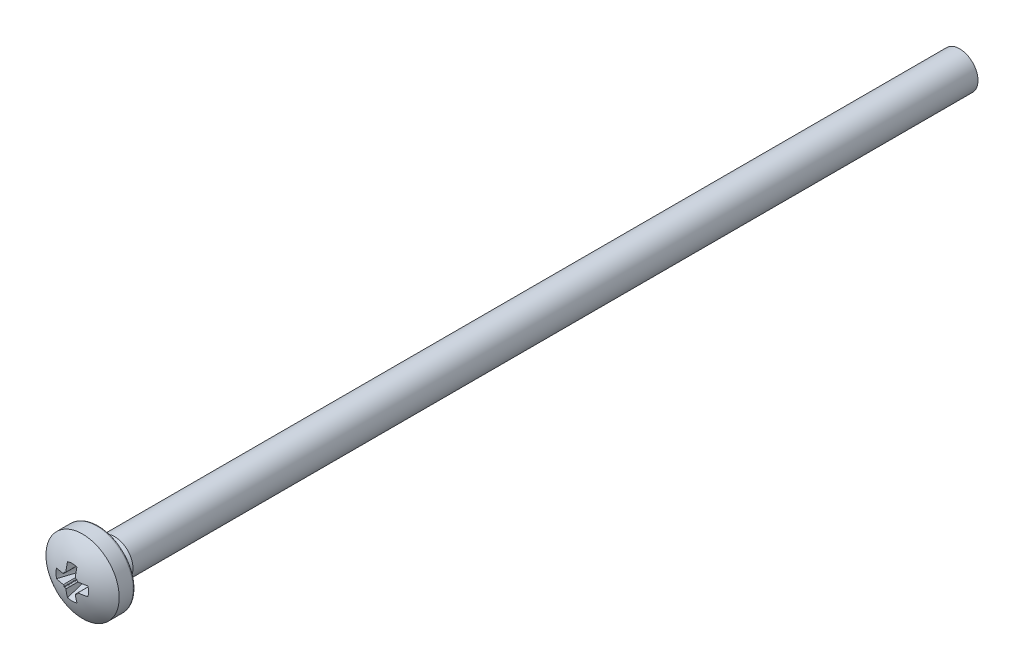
ISO-10303-21;
HEADER;
FILE_DESCRIPTION(('STEP AP214'),'2;1');
FILE_NAME('part.step','',(''),(''),'','','');
FILE_SCHEMA(('AUTOMOTIVE_DESIGN { 1 0 10303 214 1 1 1 1 }'));
ENDSEC;
DATA;
#1=APPLICATION_CONTEXT('core data for automotive mechanical design processes');
#2=APPLICATION_PROTOCOL_DEFINITION('international standard','automotive_design',2000,#1);
#3=PRODUCT_CONTEXT('',#1,'mechanical');
#4=PRODUCT('Part','Part','',(#3));
#5=PRODUCT_RELATED_PRODUCT_CATEGORY('part','',(#4));
#6=PRODUCT_DEFINITION_FORMATION('','',#4);
#7=PRODUCT_DEFINITION_CONTEXT('part definition',#1,'design');
#8=PRODUCT_DEFINITION('design','',#6,#7);
#9=PRODUCT_DEFINITION_SHAPE('','',#8);
#10=(LENGTH_UNIT() NAMED_UNIT(*) SI_UNIT(.MILLI.,.METRE.));
#11=(NAMED_UNIT(*) PLANE_ANGLE_UNIT() SI_UNIT($,.RADIAN.));
#12=(NAMED_UNIT(*) SI_UNIT($,.STERADIAN.) SOLID_ANGLE_UNIT());
#13=UNCERTAINTY_MEASURE_WITH_UNIT(LENGTH_MEASURE(1.E-05),#10,'distance_accuracy_value','');
#14=(GEOMETRIC_REPRESENTATION_CONTEXT(3) GLOBAL_UNCERTAINTY_ASSIGNED_CONTEXT((#13)) GLOBAL_UNIT_ASSIGNED_CONTEXT((#10,
#11,#12)) REPRESENTATION_CONTEXT('',''));
#15=CARTESIAN_POINT('',(0.,0.,0.));
#16=DIRECTION('',(0.,0.,1.));
#17=DIRECTION('',(1.,0.,0.));
#18=AXIS2_PLACEMENT_3D('',#15,#16,#17);
#19=CARTESIAN_POINT('',(0.,0.,-3.4));
#20=DIRECTION('',(1.,0.,0.));
#21=DIRECTION('',(0.,0.,-1.));
#22=AXIS2_PLACEMENT_3D('',#19,#20,#21);
#23=SPHERICAL_SURFACE('',#22,6.5);
#24=CARTESIAN_POINT('',(0.,0.,1.7234753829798));
#25=DIRECTION('',(0.,0.,1.));
#26=DIRECTION('',(1.,0.,0.));
#27=AXIS2_PLACEMENT_3D('',#24,#25,#26);
#28=CIRCLE('',#27,4.);
#29=CARTESIAN_POINT('',(4.,0.,1.7234753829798));
#30=VERTEX_POINT('',#29);
#31=EDGE_CURVE('E309',#30,#30,#28,.T.);
#32=ORIENTED_EDGE('',*,*,#31,.T.);
#33=EDGE_LOOP('',(#32));
#34=FACE_BOUND('',#33,.T.);
#35=CARTESIAN_POINT('',(0.0255182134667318,-0.730746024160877,-3.4));
#36=DIRECTION('',(-0.0348994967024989,0.999390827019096,0.));
#37=DIRECTION('',(0.999390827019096,0.0348994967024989,0.));
#38=AXIS2_PLACEMENT_3D('',#35,#36,#37);
#39=CIRCLE('',#38,6.45874283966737);
#40=CARTESIAN_POINT('',(0.641767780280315,-0.709226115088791,3.02924042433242));
#41=VERTEX_POINT('',#40);
#42=CARTESIAN_POINT('',(0.694396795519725,-0.707388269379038,3.02397189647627));
#43=VERTEX_POINT('',#42);
#44=EDGE_CURVE('E11',#41,#43,#39,.T.);
#45=ORIENTED_EDGE('',*,*,#44,.F.);
#46=CARTESIAN_POINT('',(0.641767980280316,-0.709226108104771,3.02924040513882));
#47=CARTESIAN_POINT('',(0.633441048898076,-0.709509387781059,3.03004051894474));
#48=CARTESIAN_POINT('',(0.6251303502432,-0.710501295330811,3.03074417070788));
#49=CARTESIAN_POINT('',(0.608780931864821,-0.713848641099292,3.03194179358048));
#50=CARTESIAN_POINT('',(0.600741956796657,-0.716202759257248,3.03243596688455));
#51=CARTESIAN_POINT('',(0.585153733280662,-0.7222233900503,3.03319971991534));
#52=CARTESIAN_POINT('',(0.577604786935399,-0.725890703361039,3.03346916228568));
#53=CARTESIAN_POINT('',(0.563216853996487,-0.734435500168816,3.03377504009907));
#54=CARTESIAN_POINT('',(0.556378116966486,-0.739313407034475,3.0338113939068));
#55=CARTESIAN_POINT('',(0.543637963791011,-0.750115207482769,3.03365016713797));
#56=CARTESIAN_POINT('',(0.537732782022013,-0.756034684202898,3.03345355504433));
#57=CARTESIAN_POINT('',(0.527000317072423,-0.768755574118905,3.032834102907));
#58=CARTESIAN_POINT('',(0.522170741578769,-0.775555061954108,3.03241175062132));
#59=CARTESIAN_POINT('',(0.516927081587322,-0.78440617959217,3.03175694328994));
#60=CARTESIAN_POINT('',(0.515945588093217,-0.786141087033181,3.03162393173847));
#61=CARTESIAN_POINT('',(0.514999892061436,-0.78789389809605,3.03148492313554));
#62=B_SPLINE_CURVE_WITH_KNOTS('',3,(#46,#47,#48,#49,#50,#51,#52,#53,#54,#55,#56,#57,#58,#59,#60,
#61),.UNSPECIFIED.,.F.,.F.,(4,2,2,2,2,2,2,4),(0.,0.0250792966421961,0.0501343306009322,
0.0752046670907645,0.10028378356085,0.125259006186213,0.150180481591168,0.156171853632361),.UNSPECIFIED.);
#63=CARTESIAN_POINT('',(0.515,-0.787893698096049,3.03148493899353));
#64=VERTEX_POINT('',#63);
#65=EDGE_CURVE('E900',#41,#64,#62,.T.);
#66=ORIENTED_EDGE('',*,*,#65,.T.);
#67=CARTESIAN_POINT('',(0.515,0.,-3.4));
#68=DIRECTION('',(1.,0.,0.));
#69=DIRECTION('',(0.,-1.,0.));
#70=AXIS2_PLACEMENT_3D('',#67,#68,#69);
#71=CIRCLE('',#70,6.47956595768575);
#72=CARTESIAN_POINT('',(0.515,-1.70562264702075,2.85105002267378));
#73=VERTEX_POINT('',#72);
#74=EDGE_CURVE('E944',#64,#73,#71,.T.);
#75=ORIENTED_EDGE('',*,*,#74,.T.);
#76=CARTESIAN_POINT('',(0.,0.,2.85105002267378));
#77=DIRECTION('',(0.,0.,-1.));
#78=DIRECTION('',(0.,1.,0.));
#79=AXIS2_PLACEMENT_3D('',#76,#77,#78);
#80=CIRCLE('',#79,1.78167719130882);
#81=CARTESIAN_POINT('',(-0.515,-1.70562264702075,2.85105002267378));
#82=VERTEX_POINT('',#81);
#83=EDGE_CURVE('E936',#73,#82,#80,.T.);
#84=ORIENTED_EDGE('',*,*,#83,.T.);
#85=CARTESIAN_POINT('',(-0.515,0.,-3.4));
#86=DIRECTION('',(1.,0.,0.));
#87=DIRECTION('',(0.,-1.,0.));
#88=AXIS2_PLACEMENT_3D('',#85,#86,#87);
#89=CIRCLE('',#88,6.47956595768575);
#90=CARTESIAN_POINT('',(-0.515,-0.78789369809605,3.03148493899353));
#91=VERTEX_POINT('',#90);
#92=EDGE_CURVE('E930',#91,#82,#89,.T.);
#93=ORIENTED_EDGE('',*,*,#92,.F.);
#94=CARTESIAN_POINT('',(-0.641767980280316,-0.709226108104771,3.02924040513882));
#95=CARTESIAN_POINT('',(-0.633441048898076,-0.709509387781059,3.03004051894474));
#96=CARTESIAN_POINT('',(-0.6251303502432,-0.710501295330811,3.03074417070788));
#97=CARTESIAN_POINT('',(-0.608780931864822,-0.713848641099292,3.03194179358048));
#98=CARTESIAN_POINT('',(-0.600741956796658,-0.716202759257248,3.03243596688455));
#99=CARTESIAN_POINT('',(-0.585153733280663,-0.7222233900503,3.03319971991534));
#100=CARTESIAN_POINT('',(-0.5776047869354,-0.725890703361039,3.03346916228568));
#101=CARTESIAN_POINT('',(-0.563216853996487,-0.734435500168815,3.03377504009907));
#102=CARTESIAN_POINT('',(-0.556378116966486,-0.739313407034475,3.0338113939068));
#103=CARTESIAN_POINT('',(-0.543637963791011,-0.750115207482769,3.03365016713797));
#104=CARTESIAN_POINT('',(-0.537732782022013,-0.756034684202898,3.03345355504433));
#105=CARTESIAN_POINT('',(-0.527000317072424,-0.768755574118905,3.032834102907));
#106=CARTESIAN_POINT('',(-0.52217074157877,-0.775555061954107,3.03241175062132));
#107=CARTESIAN_POINT('',(-0.516927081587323,-0.784406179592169,3.03175694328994));
#108=CARTESIAN_POINT('',(-0.515945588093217,-0.786141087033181,3.03162393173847));
#109=CARTESIAN_POINT('',(-0.514999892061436,-0.787893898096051,3.03148492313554));
#110=B_SPLINE_CURVE_WITH_KNOTS('',3,(#94,#95,#96,#97,#98,#99,#100,#101,#102,#103,#104,#105,#106,
#107,#108,#109),.UNSPECIFIED.,.F.,.F.,(4,2,2,2,2,2,2,4),(0.,0.0250792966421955,
0.0501343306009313,0.0752046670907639,0.10028378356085,0.125259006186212,0.150180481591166,
0.156171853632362),.UNSPECIFIED.);
#111=CARTESIAN_POINT('',(-0.641767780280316,-0.709226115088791,3.02924042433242));
#112=VERTEX_POINT('',#111);
#113=EDGE_CURVE('E924',#112,#91,#110,.T.);
#114=ORIENTED_EDGE('',*,*,#113,.F.);
#115=CARTESIAN_POINT('',(-0.0255182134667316,-0.730746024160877,-3.4));
#116=DIRECTION('',(-0.0348994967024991,-0.999390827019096,0.));
#117=DIRECTION('',(-0.999390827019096,0.0348994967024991,0.));
#118=AXIS2_PLACEMENT_3D('',#115,#116,#117);
#119=CIRCLE('',#118,6.45874283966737);
#120=CARTESIAN_POINT('',(-0.694396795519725,-0.707388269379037,3.02397189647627));
#121=VERTEX_POINT('',#120);
#122=EDGE_CURVE('E931',#112,#121,#119,.T.);
#123=ORIENTED_EDGE('',*,*,#122,.T.);
#124=CARTESIAN_POINT('',(-2.18973872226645,2.18973872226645,-1.02377385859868));
#125=DIRECTION('',(-0.560985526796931,0.560985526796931,0.608761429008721));
#126=DIRECTION('',(0.,-0.735373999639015,0.677661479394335));
#127=AXIS2_PLACEMENT_3D('',#124,#125,#126);
#128=CIRCLE('',#127,5.19746457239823);
#129=CARTESIAN_POINT('',(-0.707945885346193,-0.718048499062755,3.02130975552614));
#130=VERTEX_POINT('',#129);
#131=EDGE_CURVE('E970',#130,#121,#128,.T.);
#132=ORIENTED_EDGE('',*,*,#131,.F.);
#133=CARTESIAN_POINT('',(0.441436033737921,0.441436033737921,2.85845537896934));
#134=DIRECTION('',(0.0701860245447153,0.0701860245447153,0.995061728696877));
#135=DIRECTION('',(0.9975216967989,0.,-0.0703595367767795));
#136=AXIS2_PLACEMENT_3D('',#133,#134,#135);
#137=CIRCLE('',#136,1.64073298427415);
#138=CARTESIAN_POINT('',(-0.718048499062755,-0.707945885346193,3.02130975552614));
#139=VERTEX_POINT('',#138);
#140=EDGE_CURVE('E967',#139,#130,#137,.T.);
#141=ORIENTED_EDGE('',*,*,#140,.F.);
#142=CARTESIAN_POINT('',(2.18973872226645,-2.18973872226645,-1.02377385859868));
#143=DIRECTION('',(-0.560985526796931,0.560985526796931,-0.608761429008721));
#144=DIRECTION('',(-0.735373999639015,0.,0.677661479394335));
#145=AXIS2_PLACEMENT_3D('',#142,#143,#144);
#146=CIRCLE('',#145,5.19746457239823);
#147=CARTESIAN_POINT('',(-0.707388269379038,-0.694396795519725,3.02397189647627));
#148=VERTEX_POINT('',#147);
#149=EDGE_CURVE('E968',#139,#148,#146,.T.);
#150=ORIENTED_EDGE('',*,*,#149,.T.);
#151=CARTESIAN_POINT('',(-0.730746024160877,-0.0255182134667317,-3.4));
#152=DIRECTION('',(0.999390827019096,0.0348994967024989,0.));
#153=DIRECTION('',(0.0348994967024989,-0.999390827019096,0.));
#154=AXIS2_PLACEMENT_3D('',#151,#152,#153);
#155=CIRCLE('',#154,6.45874283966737);
#156=CARTESIAN_POINT('',(-0.709226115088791,-0.641767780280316,3.02924042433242));
#157=VERTEX_POINT('',#156);
#158=EDGE_CURVE('E584',#157,#148,#155,.T.);
#159=ORIENTED_EDGE('',*,*,#158,.F.);
#160=CARTESIAN_POINT('',(-0.709226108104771,-0.641767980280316,3.02924040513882));
#161=CARTESIAN_POINT('',(-0.709509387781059,-0.633441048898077,3.03004051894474));
#162=CARTESIAN_POINT('',(-0.710501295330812,-0.625130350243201,3.03074417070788));
#163=CARTESIAN_POINT('',(-0.713848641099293,-0.608780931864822,3.03194179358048));
#164=CARTESIAN_POINT('',(-0.716202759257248,-0.600741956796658,3.03243596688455));
#165=CARTESIAN_POINT('',(-0.7222233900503,-0.585153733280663,3.03319971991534));
#166=CARTESIAN_POINT('',(-0.72589070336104,-0.5776047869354,3.03346916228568));
#167=CARTESIAN_POINT('',(-0.734435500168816,-0.563216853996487,3.03377504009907));
#168=CARTESIAN_POINT('',(-0.739313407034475,-0.556378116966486,3.0338113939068));
#169=CARTESIAN_POINT('',(-0.750115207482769,-0.543637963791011,3.03365016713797));
#170=CARTESIAN_POINT('',(-0.756034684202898,-0.537732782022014,3.03345355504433));
#171=CARTESIAN_POINT('',(-0.768755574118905,-0.527000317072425,3.032834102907));
#172=CARTESIAN_POINT('',(-0.775555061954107,-0.522170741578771,3.03241175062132));
#173=CARTESIAN_POINT('',(-0.784406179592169,-0.516927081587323,3.03175694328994));
#174=CARTESIAN_POINT('',(-0.786141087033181,-0.515945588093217,3.03162393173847));
#175=CARTESIAN_POINT('',(-0.78789389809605,-0.514999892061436,3.03148492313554));
#176=B_SPLINE_CURVE_WITH_KNOTS('',3,(#160,#161,#162,#163,#164,#165,#166,#167,#168,#169,#170,
#171,#172,#173,#174,#175),.UNSPECIFIED.,.F.,.F.,(4,2,2,2,2,2,2,4),(0.,0.0250792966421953,
0.0501343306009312,0.075204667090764,0.10028378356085,0.125259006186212,0.150180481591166,
0.156171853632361),.UNSPECIFIED.);
#177=CARTESIAN_POINT('',(-0.78789369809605,-0.515,3.03148493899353));
#178=VERTEX_POINT('',#177);
#179=EDGE_CURVE('E578',#157,#178,#176,.T.);
#180=ORIENTED_EDGE('',*,*,#179,.T.);
#181=CARTESIAN_POINT('',(0.,-0.515,-3.4));
#182=DIRECTION('',(0.,1.,0.));
#183=DIRECTION('',(1.,0.,0.));
#184=AXIS2_PLACEMENT_3D('',#181,#182,#183);
#185=CIRCLE('',#184,6.47956595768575);
#186=CARTESIAN_POINT('',(-1.70562264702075,-0.515,2.85105002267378));
#187=VERTEX_POINT('',#186);
#188=EDGE_CURVE('E569',#187,#178,#185,.T.);
#189=ORIENTED_EDGE('',*,*,#188,.F.);
#190=CARTESIAN_POINT('',(0.,0.,2.85105002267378));
#191=DIRECTION('',(0.,0.,-1.));
#192=DIRECTION('',(0.,1.,0.));
#193=AXIS2_PLACEMENT_3D('',#190,#191,#192);
#194=CIRCLE('',#193,1.78167719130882);
#195=CARTESIAN_POINT('',(-1.70562264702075,0.515,2.85105002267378));
#196=VERTEX_POINT('',#195);
#197=EDGE_CURVE('E563',#187,#196,#194,.T.);
#198=ORIENTED_EDGE('',*,*,#197,.T.);
#199=CARTESIAN_POINT('',(0.,0.515,-3.4));
#200=DIRECTION('',(0.,1.,0.));
#201=DIRECTION('',(1.,0.,0.));
#202=AXIS2_PLACEMENT_3D('',#199,#200,#201);
#203=CIRCLE('',#202,6.47956595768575);
#204=CARTESIAN_POINT('',(-0.78789369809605,0.515,3.03148493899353));
#205=VERTEX_POINT('',#204);
#206=EDGE_CURVE('E610',#196,#205,#203,.T.);
#207=ORIENTED_EDGE('',*,*,#206,.T.);
#208=CARTESIAN_POINT('',(-0.709226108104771,0.641767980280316,3.02924040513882));
#209=CARTESIAN_POINT('',(-0.70950938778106,0.633441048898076,3.03004051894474));
#210=CARTESIAN_POINT('',(-0.710501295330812,0.6251303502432,3.03074417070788));
#211=CARTESIAN_POINT('',(-0.713848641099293,0.608780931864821,3.03194179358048));
#212=CARTESIAN_POINT('',(-0.716202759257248,0.600741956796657,3.03243596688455));
#213=CARTESIAN_POINT('',(-0.7222233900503,0.585153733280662,3.03319971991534));
#214=CARTESIAN_POINT('',(-0.72589070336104,0.577604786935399,3.03346916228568));
#215=CARTESIAN_POINT('',(-0.734435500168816,0.563216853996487,3.03377504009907));
#216=CARTESIAN_POINT('',(-0.739313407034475,0.556378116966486,3.0338113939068));
#217=CARTESIAN_POINT('',(-0.750115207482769,0.543637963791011,3.03365016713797));
#218=CARTESIAN_POINT('',(-0.756034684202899,0.537732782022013,3.03345355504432));
#219=CARTESIAN_POINT('',(-0.768755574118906,0.527000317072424,3.032834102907));
#220=CARTESIAN_POINT('',(-0.775555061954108,0.522170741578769,3.03241175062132));
#221=CARTESIAN_POINT('',(-0.78440617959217,0.516927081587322,3.03175694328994));
#222=CARTESIAN_POINT('',(-0.786141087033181,0.515945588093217,3.03162393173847));
#223=CARTESIAN_POINT('',(-0.78789389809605,0.514999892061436,3.03148492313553));
#224=B_SPLINE_CURVE_WITH_KNOTS('',3,(#208,#209,#210,#211,#212,#213,#214,#215,#216,#217,#218,
#219,#220,#221,#222,#223),.UNSPECIFIED.,.F.,.F.,(4,2,2,2,2,2,2,4),(0.,0.0250792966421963,
0.0501343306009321,0.0752046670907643,0.10028378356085,0.125259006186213,0.150180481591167,
0.156171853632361),.UNSPECIFIED.);
#225=CARTESIAN_POINT('',(-0.709226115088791,0.641767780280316,3.02924042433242));
#226=VERTEX_POINT('',#225);
#227=EDGE_CURVE('E602',#226,#205,#224,.T.);
#228=ORIENTED_EDGE('',*,*,#227,.F.);
#229=CARTESIAN_POINT('',(-0.730746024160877,0.0255182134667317,-3.4));
#230=DIRECTION('',(-0.999390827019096,0.0348994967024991,0.));
#231=DIRECTION('',(0.0348994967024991,0.999390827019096,0.));
#232=AXIS2_PLACEMENT_3D('',#229,#230,#231);
#233=CIRCLE('',#232,6.45874283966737);
#234=CARTESIAN_POINT('',(-0.707388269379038,0.694396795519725,3.02397189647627));
#235=VERTEX_POINT('',#234);
#236=EDGE_CURVE('E40',#226,#235,#233,.T.);
#237=ORIENTED_EDGE('',*,*,#236,.T.);
#238=CARTESIAN_POINT('',(2.18973872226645,2.18973872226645,-1.02377385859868));
#239=DIRECTION('',(0.560985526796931,0.560985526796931,0.608761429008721));
#240=DIRECTION('',(0.735373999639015,0.,-0.677661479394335));
#241=AXIS2_PLACEMENT_3D('',#238,#239,#240);
#242=CIRCLE('',#241,5.19746457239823);
#243=CARTESIAN_POINT('',(-0.718048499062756,0.707945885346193,3.02130975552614));
#244=VERTEX_POINT('',#243);
#245=EDGE_CURVE('E344',#244,#235,#242,.T.);
#246=ORIENTED_EDGE('',*,*,#245,.F.);
#247=CARTESIAN_POINT('',(0.44143603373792,-0.44143603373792,2.85845537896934));
#248=DIRECTION('',(0.0701860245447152,-0.0701860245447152,0.995061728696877));
#249=DIRECTION('',(0.9975216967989,0.,-0.0703595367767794));
#250=AXIS2_PLACEMENT_3D('',#247,#248,#249);
#251=CIRCLE('',#250,1.64073298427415);
#252=CARTESIAN_POINT('',(-0.707945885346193,0.718048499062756,3.02130975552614));
#253=VERTEX_POINT('',#252);
#254=EDGE_CURVE('E339',#253,#244,#251,.T.);
#255=ORIENTED_EDGE('',*,*,#254,.F.);
#256=CARTESIAN_POINT('',(-2.18973872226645,-2.18973872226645,-1.02377385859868));
#257=DIRECTION('',(0.560985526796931,0.560985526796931,-0.608761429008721));
#258=DIRECTION('',(-0.735373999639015,0.,-0.677661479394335));
#259=AXIS2_PLACEMENT_3D('',#256,#257,#258);
#260=CIRCLE('',#259,5.19746457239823);
#261=CARTESIAN_POINT('',(-0.694396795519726,0.707388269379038,3.02397189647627));
#262=VERTEX_POINT('',#261);
#263=EDGE_CURVE('E341',#253,#262,#260,.T.);
#264=ORIENTED_EDGE('',*,*,#263,.T.);
#265=CARTESIAN_POINT('',(-0.0255182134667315,0.730746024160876,-3.4));
#266=DIRECTION('',(0.034899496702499,-0.999390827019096,0.));
#267=DIRECTION('',(-0.999390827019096,-0.034899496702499,0.));
#268=AXIS2_PLACEMENT_3D('',#265,#266,#267);
#269=CIRCLE('',#268,6.45874283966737);
#270=CARTESIAN_POINT('',(-0.641767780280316,0.709226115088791,3.02924042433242));
#271=VERTEX_POINT('',#270);
#272=EDGE_CURVE('E346',#271,#262,#269,.T.);
#273=ORIENTED_EDGE('',*,*,#272,.F.);
#274=CARTESIAN_POINT('',(-0.641767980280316,0.709226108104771,3.02924040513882));
#275=CARTESIAN_POINT('',(-0.633441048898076,0.709509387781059,3.03004051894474));
#276=CARTESIAN_POINT('',(-0.6251303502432,0.710501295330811,3.03074417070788));
#277=CARTESIAN_POINT('',(-0.608780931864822,0.713848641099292,3.03194179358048));
#278=CARTESIAN_POINT('',(-0.600741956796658,0.716202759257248,3.03243596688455));
#279=CARTESIAN_POINT('',(-0.585153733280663,0.7222233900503,3.03319971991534));
#280=CARTESIAN_POINT('',(-0.5776047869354,0.725890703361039,3.03346916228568));
#281=CARTESIAN_POINT('',(-0.563216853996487,0.734435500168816,3.03377504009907));
#282=CARTESIAN_POINT('',(-0.556378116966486,0.739313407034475,3.0338113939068));
#283=CARTESIAN_POINT('',(-0.543637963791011,0.750115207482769,3.03365016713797));
#284=CARTESIAN_POINT('',(-0.537732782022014,0.756034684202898,3.03345355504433));
#285=CARTESIAN_POINT('',(-0.527000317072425,0.768755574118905,3.032834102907));
#286=CARTESIAN_POINT('',(-0.52217074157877,0.775555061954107,3.03241175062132));
#287=CARTESIAN_POINT('',(-0.516927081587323,0.784406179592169,3.03175694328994));
#288=CARTESIAN_POINT('',(-0.515945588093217,0.786141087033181,3.03162393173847));
#289=CARTESIAN_POINT('',(-0.514999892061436,0.787893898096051,3.03148492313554));
#290=B_SPLINE_CURVE_WITH_KNOTS('',3,(#274,#275,#276,#277,#278,#279,#280,#281,#282,#283,#284,
#285,#286,#287,#288,#289),.UNSPECIFIED.,.F.,.F.,(4,2,2,2,2,2,2,4),(0.,0.0250792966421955,
0.0501343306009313,0.075204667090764,0.10028378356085,0.125259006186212,0.150180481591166,
0.156171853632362),.UNSPECIFIED.);
#291=CARTESIAN_POINT('',(-0.515,0.787893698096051,3.03148493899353));
#292=VERTEX_POINT('',#291);
#293=EDGE_CURVE('E348',#271,#292,#290,.T.);
#294=ORIENTED_EDGE('',*,*,#293,.T.);
#295=CARTESIAN_POINT('',(-0.515,0.,-3.4));
#296=DIRECTION('',(1.,0.,0.));
#297=DIRECTION('',(0.,0.,-1.));
#298=AXIS2_PLACEMENT_3D('',#295,#296,#297);
#299=CIRCLE('',#298,6.47956595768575);
#300=CARTESIAN_POINT('',(-0.515,1.70562264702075,2.85105002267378));
#301=VERTEX_POINT('',#300);
#302=EDGE_CURVE('E355',#301,#292,#299,.T.);
#303=ORIENTED_EDGE('',*,*,#302,.F.);
#304=CARTESIAN_POINT('',(0.,0.,2.85105002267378));
#305=DIRECTION('',(0.,0.,-1.));
#306=DIRECTION('',(0.,1.,0.));
#307=AXIS2_PLACEMENT_3D('',#304,#305,#306);
#308=CIRCLE('',#307,1.78167719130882);
#309=CARTESIAN_POINT('',(0.515,1.70562264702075,2.85105002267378));
#310=VERTEX_POINT('',#309);
#311=EDGE_CURVE('E1076',#301,#310,#308,.T.);
#312=ORIENTED_EDGE('',*,*,#311,.T.);
#313=CARTESIAN_POINT('',(0.515,0.,-3.4));
#314=DIRECTION('',(1.,0.,0.));
#315=DIRECTION('',(0.,0.,-1.));
#316=AXIS2_PLACEMENT_3D('',#313,#314,#315);
#317=CIRCLE('',#316,6.47956595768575);
#318=CARTESIAN_POINT('',(0.515,0.787893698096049,3.03148493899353));
#319=VERTEX_POINT('',#318);
#320=EDGE_CURVE('E608',#310,#319,#317,.T.);
#321=ORIENTED_EDGE('',*,*,#320,.T.);
#322=CARTESIAN_POINT('',(0.641767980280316,0.709226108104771,3.02924040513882));
#323=CARTESIAN_POINT('',(0.633441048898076,0.709509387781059,3.03004051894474));
#324=CARTESIAN_POINT('',(0.6251303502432,0.710501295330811,3.03074417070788));
#325=CARTESIAN_POINT('',(0.608780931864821,0.713848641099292,3.03194179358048));
#326=CARTESIAN_POINT('',(0.600741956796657,0.716202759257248,3.03243596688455));
#327=CARTESIAN_POINT('',(0.585153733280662,0.7222233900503,3.03319971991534));
#328=CARTESIAN_POINT('',(0.577604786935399,0.725890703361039,3.03346916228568));
#329=CARTESIAN_POINT('',(0.563216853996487,0.734435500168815,3.03377504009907));
#330=CARTESIAN_POINT('',(0.556378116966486,0.739313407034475,3.0338113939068));
#331=CARTESIAN_POINT('',(0.543637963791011,0.750115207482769,3.03365016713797));
#332=CARTESIAN_POINT('',(0.537732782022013,0.756034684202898,3.03345355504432));
#333=CARTESIAN_POINT('',(0.527000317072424,0.768755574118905,3.032834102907));
#334=CARTESIAN_POINT('',(0.522170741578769,0.775555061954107,3.03241175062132));
#335=CARTESIAN_POINT('',(0.516927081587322,0.784406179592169,3.03175694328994));
#336=CARTESIAN_POINT('',(0.515945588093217,0.78614108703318,3.03162393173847));
#337=CARTESIAN_POINT('',(0.514999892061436,0.787893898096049,3.03148492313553));
#338=B_SPLINE_CURVE_WITH_KNOTS('',3,(#322,#323,#324,#325,#326,#327,#328,#329,#330,#331,#332,
#333,#334,#335,#336,#337),.UNSPECIFIED.,.F.,.F.,(4,2,2,2,2,2,2,4),(0.,0.0250792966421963,
0.0501343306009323,0.0752046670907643,0.10028378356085,0.125259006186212,0.150180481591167,
0.156171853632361),.UNSPECIFIED.);
#339=CARTESIAN_POINT('',(0.641767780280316,0.709226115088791,3.02924042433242));
#340=VERTEX_POINT('',#339);
#341=EDGE_CURVE('E556',#340,#319,#338,.T.);
#342=ORIENTED_EDGE('',*,*,#341,.F.);
#343=CARTESIAN_POINT('',(0.0255182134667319,0.730746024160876,-3.4));
#344=DIRECTION('',(0.034899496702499,0.999390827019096,0.));
#345=DIRECTION('',(0.999390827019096,-0.034899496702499,0.));
#346=AXIS2_PLACEMENT_3D('',#343,#344,#345);
#347=CIRCLE('',#346,6.45874283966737);
#348=CARTESIAN_POINT('',(0.694396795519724,0.707388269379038,3.02397189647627));
#349=VERTEX_POINT('',#348);
#350=EDGE_CURVE('E562',#340,#349,#347,.T.);
#351=ORIENTED_EDGE('',*,*,#350,.T.);
#352=CARTESIAN_POINT('',(2.18973872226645,-2.18973872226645,-1.02377385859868));
#353=DIRECTION('',(0.560985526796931,-0.560985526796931,0.608761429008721));
#354=DIRECTION('',(0.,-0.735373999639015,-0.677661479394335));
#355=AXIS2_PLACEMENT_3D('',#352,#353,#354);
#356=CIRCLE('',#355,5.19746457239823);
#357=CARTESIAN_POINT('',(0.707945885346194,0.718048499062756,3.02130975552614));
#358=VERTEX_POINT('',#357);
#359=EDGE_CURVE('E567',#358,#349,#356,.T.);
#360=ORIENTED_EDGE('',*,*,#359,.F.);
#361=CARTESIAN_POINT('',(-0.44143603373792,-0.441436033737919,2.85845537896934));
#362=DIRECTION('',(-0.0701860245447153,-0.0701860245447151,0.995061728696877));
#363=DIRECTION('',(0.9975216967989,0.,0.0703595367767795));
#364=AXIS2_PLACEMENT_3D('',#361,#362,#363);
#365=CIRCLE('',#364,1.64073298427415);
#366=CARTESIAN_POINT('',(0.718048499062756,0.707945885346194,3.02130975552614));
#367=VERTEX_POINT('',#366);
#368=EDGE_CURVE('E571',#367,#358,#365,.T.);
#369=ORIENTED_EDGE('',*,*,#368,.F.);
#370=CARTESIAN_POINT('',(-2.18973872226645,2.18973872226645,-1.02377385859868));
#371=DIRECTION('',(0.560985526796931,-0.560985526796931,-0.608761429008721));
#372=DIRECTION('',(0.,0.735373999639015,-0.677661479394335));
#373=AXIS2_PLACEMENT_3D('',#370,#371,#372);
#374=CIRCLE('',#373,5.19746457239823);
#375=CARTESIAN_POINT('',(0.707388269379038,0.694396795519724,3.02397189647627));
#376=VERTEX_POINT('',#375);
#377=EDGE_CURVE('E573',#367,#376,#374,.T.);
#378=ORIENTED_EDGE('',*,*,#377,.T.);
#379=CARTESIAN_POINT('',(0.730746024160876,0.0255182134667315,-3.4));
#380=DIRECTION('',(-0.999390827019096,-0.0348994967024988,0.));
#381=DIRECTION('',(-0.0348994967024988,0.999390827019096,0.));
#382=AXIS2_PLACEMENT_3D('',#379,#380,#381);
#383=CIRCLE('',#382,6.45874283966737);
#384=CARTESIAN_POINT('',(0.709226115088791,0.641767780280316,3.02924042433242));
#385=VERTEX_POINT('',#384);
#386=EDGE_CURVE('E576',#385,#376,#383,.T.);
#387=ORIENTED_EDGE('',*,*,#386,.F.);
#388=CARTESIAN_POINT('',(0.709226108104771,0.641767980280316,3.02924040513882));
#389=CARTESIAN_POINT('',(0.709509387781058,0.633441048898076,3.03004051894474));
#390=CARTESIAN_POINT('',(0.710501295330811,0.6251303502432,3.03074417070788));
#391=CARTESIAN_POINT('',(0.713848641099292,0.608780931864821,3.03194179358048));
#392=CARTESIAN_POINT('',(0.716202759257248,0.600741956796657,3.03243596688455));
#393=CARTESIAN_POINT('',(0.7222233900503,0.585153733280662,3.03319971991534));
#394=CARTESIAN_POINT('',(0.725890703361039,0.577604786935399,3.03346916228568));
#395=CARTESIAN_POINT('',(0.734435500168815,0.563216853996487,3.03377504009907));
#396=CARTESIAN_POINT('',(0.739313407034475,0.556378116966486,3.0338113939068));
#397=CARTESIAN_POINT('',(0.750115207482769,0.543637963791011,3.03365016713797));
#398=CARTESIAN_POINT('',(0.756034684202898,0.537732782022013,3.03345355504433));
#399=CARTESIAN_POINT('',(0.768755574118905,0.527000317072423,3.032834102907));
#400=CARTESIAN_POINT('',(0.775555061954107,0.522170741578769,3.03241175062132));
#401=CARTESIAN_POINT('',(0.784406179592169,0.516927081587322,3.03175694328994));
#402=CARTESIAN_POINT('',(0.786141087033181,0.515945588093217,3.03162393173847));
#403=CARTESIAN_POINT('',(0.78789389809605,0.514999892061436,3.03148492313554));
#404=B_SPLINE_CURVE_WITH_KNOTS('',3,(#388,#389,#390,#391,#392,#393,#394,#395,#396,#397,#398,
#399,#400,#401,#402,#403),.UNSPECIFIED.,.F.,.F.,(4,2,2,2,2,2,2,4),(0.,0.0250792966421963,
0.0501343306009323,0.0752046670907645,0.10028378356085,0.125259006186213,0.150180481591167,
0.156171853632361),.UNSPECIFIED.);
#405=CARTESIAN_POINT('',(0.78789369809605,0.515,3.03148493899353));
#406=VERTEX_POINT('',#405);
#407=EDGE_CURVE('E961',#385,#406,#404,.T.);
#408=ORIENTED_EDGE('',*,*,#407,.T.);
#409=CARTESIAN_POINT('',(0.,0.515,-3.4));
#410=DIRECTION('',(0.,1.,0.));
#411=DIRECTION('',(1.,0.,0.));
#412=AXIS2_PLACEMENT_3D('',#409,#410,#411);
#413=CIRCLE('',#412,6.47956595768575);
#414=CARTESIAN_POINT('',(1.70562264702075,0.515,2.85105002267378));
#415=VERTEX_POINT('',#414);
#416=EDGE_CURVE('E972',#406,#415,#413,.T.);
#417=ORIENTED_EDGE('',*,*,#416,.T.);
#418=CARTESIAN_POINT('',(0.,0.,2.85105002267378));
#419=DIRECTION('',(0.,0.,-1.));
#420=DIRECTION('',(0.,1.,0.));
#421=AXIS2_PLACEMENT_3D('',#418,#419,#420);
#422=CIRCLE('',#421,1.78167719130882);
#423=CARTESIAN_POINT('',(1.70562264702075,-0.515,2.85105002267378));
#424=VERTEX_POINT('',#423);
#425=EDGE_CURVE('E974',#415,#424,#422,.T.);
#426=ORIENTED_EDGE('',*,*,#425,.T.);
#427=CARTESIAN_POINT('',(0.,-0.515,-3.4));
#428=DIRECTION('',(0.,1.,0.));
#429=DIRECTION('',(1.,0.,0.));
#430=AXIS2_PLACEMENT_3D('',#427,#428,#429);
#431=CIRCLE('',#430,6.47956595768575);
#432=CARTESIAN_POINT('',(0.787893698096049,-0.515,3.03148493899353));
#433=VERTEX_POINT('',#432);
#434=EDGE_CURVE('E934',#433,#424,#431,.T.);
#435=ORIENTED_EDGE('',*,*,#434,.F.);
#436=CARTESIAN_POINT('',(0.70922610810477,-0.641767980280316,3.02924040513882));
#437=CARTESIAN_POINT('',(0.709509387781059,-0.633441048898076,3.03004051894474));
#438=CARTESIAN_POINT('',(0.710501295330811,-0.6251303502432,3.03074417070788));
#439=CARTESIAN_POINT('',(0.713848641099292,-0.608780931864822,3.03194179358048));
#440=CARTESIAN_POINT('',(0.716202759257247,-0.600741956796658,3.03243596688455));
#441=CARTESIAN_POINT('',(0.722223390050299,-0.585153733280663,3.03319971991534));
#442=CARTESIAN_POINT('',(0.725890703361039,-0.5776047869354,3.03346916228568));
#443=CARTESIAN_POINT('',(0.734435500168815,-0.563216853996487,3.03377504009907));
#444=CARTESIAN_POINT('',(0.739313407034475,-0.556378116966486,3.0338113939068));
#445=CARTESIAN_POINT('',(0.750115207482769,-0.543637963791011,3.03365016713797));
#446=CARTESIAN_POINT('',(0.756034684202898,-0.537732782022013,3.03345355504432));
#447=CARTESIAN_POINT('',(0.768755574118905,-0.527000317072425,3.032834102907));
#448=CARTESIAN_POINT('',(0.775555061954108,-0.522170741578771,3.03241175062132));
#449=CARTESIAN_POINT('',(0.784406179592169,-0.516927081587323,3.03175694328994));
#450=CARTESIAN_POINT('',(0.78614108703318,-0.515945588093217,3.03162393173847));
#451=CARTESIAN_POINT('',(0.787893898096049,-0.514999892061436,3.03148492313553));
#452=B_SPLINE_CURVE_WITH_KNOTS('',3,(#436,#437,#438,#439,#440,#441,#442,#443,#444,#445,#446,
#447,#448,#449,#450,#451),.UNSPECIFIED.,.F.,.F.,(4,2,2,2,2,2,2,4),(0.,0.0250792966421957,
0.0501343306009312,0.0752046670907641,0.10028378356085,0.125259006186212,0.150180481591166,
0.156171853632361),.UNSPECIFIED.);
#453=CARTESIAN_POINT('',(0.709226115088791,-0.641767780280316,3.02924042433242));
#454=VERTEX_POINT('',#453);
#455=EDGE_CURVE('E939',#454,#433,#452,.T.);
#456=ORIENTED_EDGE('',*,*,#455,.F.);
#457=CARTESIAN_POINT('',(0.730746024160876,-0.0255182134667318,-3.4));
#458=DIRECTION('',(0.999390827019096,-0.0348994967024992,0.));
#459=DIRECTION('',(-0.0348994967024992,-0.999390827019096,0.));
#460=AXIS2_PLACEMENT_3D('',#457,#458,#459);
#461=CIRCLE('',#460,6.45874283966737);
#462=CARTESIAN_POINT('',(0.707388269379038,-0.694396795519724,3.02397189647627));
#463=VERTEX_POINT('',#462);
#464=EDGE_CURVE('E1117',#454,#463,#461,.T.);
#465=ORIENTED_EDGE('',*,*,#464,.T.);
#466=CARTESIAN_POINT('',(-2.18973872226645,-2.18973872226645,-1.02377385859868));
#467=DIRECTION('',(-0.560985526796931,-0.560985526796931,0.608761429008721));
#468=DIRECTION('',(0.735373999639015,0.,0.677661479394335));
#469=AXIS2_PLACEMENT_3D('',#466,#467,#468);
#470=CIRCLE('',#469,5.19746457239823);
#471=CARTESIAN_POINT('',(0.718048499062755,-0.707945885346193,3.02130975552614));
#472=VERTEX_POINT('',#471);
#473=EDGE_CURVE('E907',#472,#463,#470,.T.);
#474=ORIENTED_EDGE('',*,*,#473,.F.);
#475=CARTESIAN_POINT('',(-0.44143603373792,0.441436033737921,2.85845537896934));
#476=DIRECTION('',(-0.0701860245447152,0.0701860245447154,0.995061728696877));
#477=DIRECTION('',(0.,-0.9975216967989,0.0703595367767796));
#478=AXIS2_PLACEMENT_3D('',#475,#476,#477);
#479=CIRCLE('',#478,1.64073298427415);
#480=CARTESIAN_POINT('',(0.707945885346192,-0.718048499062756,3.02130975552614));
#481=VERTEX_POINT('',#480);
#482=EDGE_CURVE('E899',#481,#472,#479,.T.);
#483=ORIENTED_EDGE('',*,*,#482,.F.);
#484=CARTESIAN_POINT('',(2.18973872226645,2.18973872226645,-1.02377385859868));
#485=DIRECTION('',(-0.560985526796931,-0.560985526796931,-0.608761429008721));
#486=DIRECTION('',(0.,0.735373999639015,-0.677661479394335));
#487=AXIS2_PLACEMENT_3D('',#484,#485,#486);
#488=CIRCLE('',#487,5.19746457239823);
#489=EDGE_CURVE('E25',#481,#43,#488,.T.);
#490=ORIENTED_EDGE('',*,*,#489,.T.);
#491=EDGE_LOOP('',(#45,#66,#75,#84,#93,#114,#123,#132,#141,#150,#159,#180,#189,#198,#207,#228,
#237,#246,#255,#264,#273,#294,#303,#312,#321,#342,#351,#360,#369,#378,#387,#408,#417,#426,#435,
#456,#465,#474,#483,#490));
#492=FACE_BOUND('',#491,.T.);
#493=ADVANCED_FACE('F17',(#34,#492),#23,.T.);
#494=CARTESIAN_POINT('',(0.,0.,-94.));
#495=DIRECTION('',(0.,0.,1.));
#496=DIRECTION('',(1.,0.,0.));
#497=AXIS2_PLACEMENT_3D('',#494,#495,#496);
#498=PLANE('',#497);
#499=CARTESIAN_POINT('',(0.,0.,-94.));
#500=DIRECTION('',(0.,0.,1.));
#501=DIRECTION('',(1.,0.,0.));
#502=AXIS2_PLACEMENT_3D('',#499,#500,#501);
#503=CIRCLE('',#502,2.);
#504=CARTESIAN_POINT('',(2.00000000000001,0.,-94.));
#505=VERTEX_POINT('',#504);
#506=EDGE_CURVE('E336',#505,#505,#503,.T.);
#507=ORIENTED_EDGE('',*,*,#506,.F.);
#508=EDGE_LOOP('',(#507));
#509=FACE_BOUND('',#508,.T.);
#510=ADVANCED_FACE('F701',(#509),#498,.F.);
#511=CARTESIAN_POINT('',(0.,0.,0.));
#512=DIRECTION('',(0.,0.,1.));
#513=DIRECTION('',(1.,0.,0.));
#514=AXIS2_PLACEMENT_3D('',#511,#512,#513);
#515=CYLINDRICAL_SURFACE('',#514,2.);
#516=CARTESIAN_POINT('',(0.,0.,-1.778875));
#517=DIRECTION('',(0.,0.,1.));
#518=DIRECTION('',(1.,0.,0.));
#519=AXIS2_PLACEMENT_3D('',#516,#517,#518);
#520=CIRCLE('',#519,2.);
#521=CARTESIAN_POINT('',(2.,0.,-1.778875));
#522=VERTEX_POINT('',#521);
#523=EDGE_CURVE('E333',#522,#522,#520,.T.);
#524=ORIENTED_EDGE('',*,*,#523,.F.);
#525=EDGE_LOOP('',(#524));
#526=FACE_BOUND('',#525,.T.);
#527=ORIENTED_EDGE('',*,*,#506,.T.);
#528=EDGE_LOOP('',(#527));
#529=FACE_BOUND('',#528,.T.);
#530=ADVANCED_FACE('F706',(#526,#529),#515,.T.);
#531=CARTESIAN_POINT('',(0.,0.,-1.778875));
#532=DIRECTION('',(0.,0.,-1.));
#533=DIRECTION('',(-1.,0.,0.));
#534=AXIS2_PLACEMENT_3D('',#531,#532,#533);
#535=CONICAL_SURFACE('',#534,2.,0.785398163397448);
#536=CARTESIAN_POINT('',(0.,0.,-1.4));
#537=DIRECTION('',(0.,0.,1.));
#538=DIRECTION('',(1.,0.,0.));
#539=AXIS2_PLACEMENT_3D('',#536,#537,#538);
#540=CIRCLE('',#539,1.621125);
#541=CARTESIAN_POINT('',(1.621125,0.,-1.4));
#542=VERTEX_POINT('',#541);
#543=EDGE_CURVE('E330',#542,#542,#540,.T.);
#544=ORIENTED_EDGE('',*,*,#543,.F.);
#545=EDGE_LOOP('',(#544));
#546=FACE_BOUND('',#545,.T.);
#547=ORIENTED_EDGE('',*,*,#523,.T.);
#548=EDGE_LOOP('',(#547));
#549=FACE_BOUND('',#548,.T.);
#550=ADVANCED_FACE('F743',(#546,#549),#535,.T.);
#551=CARTESIAN_POINT('',(0.,0.,0.));
#552=DIRECTION('',(0.,0.,1.));
#553=DIRECTION('',(1.,0.,0.));
#554=AXIS2_PLACEMENT_3D('',#551,#552,#553);
#555=CYLINDRICAL_SURFACE('',#554,1.621125);
#556=CARTESIAN_POINT('',(0.,0.,-0.46));
#557=DIRECTION('',(0.,0.,1.));
#558=DIRECTION('',(1.,0.,0.));
#559=AXIS2_PLACEMENT_3D('',#556,#557,#558);
#560=CIRCLE('',#559,1.621125);
#561=CARTESIAN_POINT('',(1.621125,0.,-0.46));
#562=VERTEX_POINT('',#561);
#563=EDGE_CURVE('E327',#562,#562,#560,.T.);
#564=ORIENTED_EDGE('',*,*,#563,.F.);
#565=EDGE_LOOP('',(#564));
#566=FACE_BOUND('',#565,.T.);
#567=ORIENTED_EDGE('',*,*,#543,.T.);
#568=EDGE_LOOP('',(#567));
#569=FACE_BOUND('',#568,.T.);
#570=ADVANCED_FACE('F739',(#566,#569),#555,.T.);
#571=CARTESIAN_POINT('',(0.,0.,-0.46));
#572=DIRECTION('',(0.,0.,1.));
#573=DIRECTION('',(1.,0.,0.));
#574=AXIS2_PLACEMENT_3D('',#571,#572,#573);
#575=TOROIDAL_SURFACE('',#574,1.821125,0.2);
#576=ORIENTED_EDGE('',*,*,#563,.T.);
#577=EDGE_LOOP('',(#576));
#578=FACE_BOUND('',#577,.T.);
#579=CARTESIAN_POINT('',(0.,0.,-0.271626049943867));
#580=DIRECTION('',(0.,0.,1.));
#581=DIRECTION('',(1.,0.,0.));
#582=AXIS2_PLACEMENT_3D('',#579,#580,#581);
#583=CIRCLE('',#582,1.75392935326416);
#584=CARTESIAN_POINT('',(1.75392935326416,0.,-0.271626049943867));
#585=VERTEX_POINT('',#584);
#586=EDGE_CURVE('E324',#585,#585,#583,.T.);
#587=ORIENTED_EDGE('',*,*,#586,.F.);
#588=EDGE_LOOP('',(#587));
#589=FACE_BOUND('',#588,.T.);
#590=ADVANCED_FACE('F733',(#578,#589),#575,.F.);
#591=CARTESIAN_POINT('',(0.,0.,-0.271626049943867));
#592=DIRECTION('',(0.,0.,1.));
#593=DIRECTION('',(1.,0.,0.));
#594=AXIS2_PLACEMENT_3D('',#591,#592,#593);
#595=CONICAL_SURFACE('',#594,1.75392935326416,1.22815268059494);
#596=CARTESIAN_POINT('',(0.,0.,-0.0116260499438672));
#597=DIRECTION('',(0.,0.,1.));
#598=DIRECTION('',(1.,0.,0.));
#599=AXIS2_PLACEMENT_3D('',#596,#597,#598);
#600=CIRCLE('',#599,2.48280435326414);
#601=CARTESIAN_POINT('',(2.48280435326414,0.,-0.011626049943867));
#602=VERTEX_POINT('',#601);
#603=EDGE_CURVE('E321',#602,#602,#600,.T.);
#604=ORIENTED_EDGE('',*,*,#603,.F.);
#605=EDGE_LOOP('',(#604));
#606=FACE_BOUND('',#605,.T.);
#607=ORIENTED_EDGE('',*,*,#586,.T.);
#608=EDGE_LOOP('',(#607));
#609=FACE_BOUND('',#608,.T.);
#610=ADVANCED_FACE('F727',(#606,#609),#595,.T.);
#611=CARTESIAN_POINT('',(0.,0.,-0.2));
#612=DIRECTION('',(0.,0.,1.));
#613=DIRECTION('',(1.,0.,0.));
#614=AXIS2_PLACEMENT_3D('',#611,#612,#613);
#615=TOROIDAL_SURFACE('',#614,2.55,0.2);
#616=ORIENTED_EDGE('',*,*,#603,.T.);
#617=EDGE_LOOP('',(#616));
#618=FACE_BOUND('',#617,.T.);
#619=CARTESIAN_POINT('',(0.,0.,0.));
#620=DIRECTION('',(0.,0.,1.));
#621=DIRECTION('',(1.,0.,0.));
#622=AXIS2_PLACEMENT_3D('',#619,#620,#621);
#623=CIRCLE('',#622,2.55);
#624=CARTESIAN_POINT('',(2.55,0.,0.));
#625=VERTEX_POINT('',#624);
#626=EDGE_CURVE('E318',#625,#625,#623,.T.);
#627=ORIENTED_EDGE('',*,*,#626,.F.);
#628=EDGE_LOOP('',(#627));
#629=FACE_BOUND('',#628,.T.);
#630=ADVANCED_FACE('F722',(#618,#629),#615,.F.);
#631=CARTESIAN_POINT('',(0.,2.55,0.));
#632=DIRECTION('',(0.,0.,1.));
#633=DIRECTION('',(1.,0.,0.));
#634=AXIS2_PLACEMENT_3D('',#631,#632,#633);
#635=PLANE('',#634);
#636=CARTESIAN_POINT('',(0.,0.,0.));
#637=DIRECTION('',(0.,0.,1.));
#638=DIRECTION('',(1.,0.,0.));
#639=AXIS2_PLACEMENT_3D('',#636,#637,#638);
#640=CIRCLE('',#639,3.8);
#641=CARTESIAN_POINT('',(3.8,0.,0.));
#642=VERTEX_POINT('',#641);
#643=EDGE_CURVE('E315',#642,#642,#640,.T.);
#644=ORIENTED_EDGE('',*,*,#643,.F.);
#645=EDGE_LOOP('',(#644));
#646=FACE_BOUND('',#645,.T.);
#647=ORIENTED_EDGE('',*,*,#626,.T.);
#648=EDGE_LOOP('',(#647));
#649=FACE_BOUND('',#648,.T.);
#650=ADVANCED_FACE('F717',(#646,#649),#635,.F.);
#651=CARTESIAN_POINT('',(0.,0.,0.2));
#652=DIRECTION('',(0.,0.,1.));
#653=DIRECTION('',(1.,0.,0.));
#654=AXIS2_PLACEMENT_3D('',#651,#652,#653);
#655=TOROIDAL_SURFACE('',#654,3.8,0.2);
#656=CARTESIAN_POINT('',(0.,0.,0.2));
#657=DIRECTION('',(0.,0.,1.));
#658=DIRECTION('',(1.,0.,0.));
#659=AXIS2_PLACEMENT_3D('',#656,#657,#658);
#660=CIRCLE('',#659,4.);
#661=CARTESIAN_POINT('',(4.,0.,0.2));
#662=VERTEX_POINT('',#661);
#663=EDGE_CURVE('E312',#662,#662,#660,.T.);
#664=ORIENTED_EDGE('',*,*,#663,.F.);
#665=EDGE_LOOP('',(#664));
#666=FACE_BOUND('',#665,.T.);
#667=ORIENTED_EDGE('',*,*,#643,.T.);
#668=EDGE_LOOP('',(#667));
#669=FACE_BOUND('',#668,.T.);
#670=ADVANCED_FACE('F712',(#666,#669),#655,.T.);
#671=CARTESIAN_POINT('',(0.,0.,0.));
#672=DIRECTION('',(0.,0.,1.));
#673=DIRECTION('',(1.,0.,0.));
#674=AXIS2_PLACEMENT_3D('',#671,#672,#673);
#675=CYLINDRICAL_SURFACE('',#674,4.);
#676=ORIENTED_EDGE('',*,*,#31,.F.);
#677=EDGE_LOOP('',(#676));
#678=FACE_BOUND('',#677,.T.);
#679=ORIENTED_EDGE('',*,*,#663,.T.);
#680=EDGE_LOOP('',(#679));
#681=FACE_BOUND('',#680,.T.);
#682=ADVANCED_FACE('F399',(#678,#681),#675,.T.);
#683=CARTESIAN_POINT('',(-0.859134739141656,0.647002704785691,0.18989996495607));
#684=DIRECTION('',(0.,0.,1.));
#685=DIRECTION('',(0.,-1.,0.));
#686=AXIS2_PLACEMENT_3D('',#683,#684,#685);
#687=CYLINDRICAL_SURFACE('',#686,0.15);
#688=ORIENTED_EDGE('',*,*,#227,.T.);
#689=DIRECTION('',(0.,0.,1.));
#690=VECTOR('',#689,1.);
#691=CARTESIAN_POINT('',(-0.78789369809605,0.515,0.18989996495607));
#692=LINE('',#691,#690);
#693=CARTESIAN_POINT('',(-0.78789369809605,0.515,0.690385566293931));
#694=VERTEX_POINT('',#693);
#695=EDGE_CURVE('E1024',#205,#694,#692,.F.);
#696=ORIENTED_EDGE('',*,*,#695,.T.);
#697=CARTESIAN_POINT('',(-0.78789389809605,0.514999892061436,0.690385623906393));
#698=CARTESIAN_POINT('',(-0.781585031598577,0.518394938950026,0.688563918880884));
#699=CARTESIAN_POINT('',(-0.775461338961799,0.522292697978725,0.687007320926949));
#700=CARTESIAN_POINT('',(-0.763760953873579,0.531001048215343,0.684488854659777));
#701=CARTESIAN_POINT('',(-0.758184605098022,0.535812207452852,0.68352735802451));
#702=CARTESIAN_POINT('',(-0.747750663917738,0.546263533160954,0.682264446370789));
#703=CARTESIAN_POINT('',(-0.742894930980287,0.551905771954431,0.681964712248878));
#704=CARTESIAN_POINT('',(-0.734081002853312,0.563837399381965,0.68204944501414));
#705=CARTESIAN_POINT('',(-0.730121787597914,0.570126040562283,0.682433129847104));
#706=CARTESIAN_POINT('',(-0.723301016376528,0.582967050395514,0.68383633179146));
#707=CARTESIAN_POINT('',(-0.720410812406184,0.589506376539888,0.68483697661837));
#708=CARTESIAN_POINT('',(-0.715609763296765,0.602835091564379,0.687400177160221));
#709=CARTESIAN_POINT('',(-0.713699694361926,0.609624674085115,0.688963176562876));
#710=CARTESIAN_POINT('',(-0.711401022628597,0.620670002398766,0.691882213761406));
#711=CARTESIAN_POINT('',(-0.710710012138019,0.624905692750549,0.693090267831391));
#712=CARTESIAN_POINT('',(-0.709696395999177,0.633356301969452,0.695666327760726));
#713=CARTESIAN_POINT('',(-0.709372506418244,0.637571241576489,0.697033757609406));
#714=CARTESIAN_POINT('',(-0.709226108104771,0.641767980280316,0.69847324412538));
#715=B_SPLINE_CURVE_WITH_KNOTS('',3,(#697,#698,#699,#700,#701,#702,#703,#704,#705,#706,#707,
#708,#709,#710,#711,#712,#713,#714),.UNSPECIFIED.,.F.,.F.,(4,2,2,2,2,2,2,2,4),(0.,
0.0221656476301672,0.0443451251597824,0.0665808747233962,0.0887911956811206,0.1103536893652,
0.131933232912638,0.145292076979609,0.15860405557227),.UNSPECIFIED.);
#716=CARTESIAN_POINT('',(-0.709226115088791,0.641767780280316,0.698473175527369));
#717=VERTEX_POINT('',#716);
#718=EDGE_CURVE('E530',#694,#717,#715,.T.);
#719=ORIENTED_EDGE('',*,*,#718,.T.);
#720=DIRECTION('',(0.,0.,1.));
#721=VECTOR('',#720,1.);
#722=CARTESIAN_POINT('',(-0.709226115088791,0.641767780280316,0.18989996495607));
#723=LINE('',#722,#721);
#724=EDGE_CURVE('E1002',#717,#226,#723,.T.);
#725=ORIENTED_EDGE('',*,*,#724,.T.);
#726=EDGE_LOOP('',(#688,#696,#719,#725));
#727=FACE_BOUND('',#726,.T.);
#728=ADVANCED_FACE('F594',(#727),#687,.T.);
#729=CARTESIAN_POINT('',(-0.706949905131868,0.706949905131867,0.18989996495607));
#730=DIRECTION('',(-0.999390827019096,0.0348994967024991,0.));
#731=DIRECTION('',(-0.0348994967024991,-0.999390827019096,0.));
#732=AXIS2_PLACEMENT_3D('',#729,#730,#731);
#733=PLANE('',#732);
#734=ORIENTED_EDGE('',*,*,#724,.F.);
#735=CARTESIAN_POINT('',(-0.706949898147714,0.706950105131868,0.721491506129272));
#736=CARTESIAN_POINT('',(-0.707328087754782,0.6961201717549,0.717559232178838));
#737=CARTESIAN_POINT('',(-0.707706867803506,0.685273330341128,0.713674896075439));
#738=CARTESIAN_POINT('',(-0.7084656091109,0.663545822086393,0.706002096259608));
#739=CARTESIAN_POINT('',(-0.708845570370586,0.652665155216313,0.702213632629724));
#740=CARTESIAN_POINT('',(-0.709226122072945,0.641767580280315,0.698473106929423));
#741=B_SPLINE_CURVE_WITH_KNOTS('',3,(#735,#736,#737,#738,#739,#740),.UNSPECIFIED.,.F.,.F.,(4,2,
4),(0.,0.0345827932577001,0.0691656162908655),.UNSPECIFIED.);
#742=CARTESIAN_POINT('',(-0.706949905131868,0.706949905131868,0.721491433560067));
#743=VERTEX_POINT('',#742);
#744=EDGE_CURVE('E282',#743,#717,#741,.T.);
#745=ORIENTED_EDGE('',*,*,#744,.F.);
#746=DIRECTION('',(0.,0.,1.));
#747=VECTOR('',#746,1.);
#748=CARTESIAN_POINT('',(-0.706949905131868,0.706949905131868,0.18989996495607));
#749=LINE('',#748,#747);
#750=CARTESIAN_POINT('',(-0.706949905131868,0.706949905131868,3.02045667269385));
#751=VERTEX_POINT('',#750);
#752=EDGE_CURVE('E277',#743,#751,#749,.T.);
#753=ORIENTED_EDGE('',*,*,#752,.T.);
#754=DIRECTION('',(0.034819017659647,0.997086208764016,0.0678728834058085));
#755=VECTOR('',#754,1.);
#756=CARTESIAN_POINT('',(-0.713639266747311,0.515391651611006,3.00741706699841));
#757=LINE('',#756,#755);
#758=CARTESIAN_POINT('',(-0.707238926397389,0.698673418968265,3.01989328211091));
#759=VERTEX_POINT('',#758);
#760=EDGE_CURVE('E280',#759,#751,#757,.T.);
#761=ORIENTED_EDGE('',*,*,#760,.F.);
#762=DIRECTION('',(0.0252627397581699,0.723430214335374,-0.689935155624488));
#763=VECTOR('',#762,1.);
#764=CARTESIAN_POINT('',(-0.657761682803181,2.1155162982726,1.66865069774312));
#765=LINE('',#764,#763);
#766=EDGE_CURVE('E302',#235,#759,#765,.T.);
#767=ORIENTED_EDGE('',*,*,#766,.F.);
#768=ORIENTED_EDGE('',*,*,#236,.F.);
#769=EDGE_LOOP('',(#734,#745,#753,#761,#767,#768));
#770=FACE_BOUND('',#769,.T.);
#771=ADVANCED_FACE('F279',(#770),#733,.F.);
#772=CARTESIAN_POINT('',(0.706949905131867,0.706949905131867,0.189899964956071));
#773=DIRECTION('',(0.034899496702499,0.999390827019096,0.));
#774=DIRECTION('',(-0.999390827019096,0.034899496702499,0.));
#775=AXIS2_PLACEMENT_3D('',#772,#773,#774);
#776=PLANE('',#775);
#777=DIRECTION('',(0.,0.,1.));
#778=VECTOR('',#777,1.);
#779=CARTESIAN_POINT('',(0.641767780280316,0.709226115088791,0.18989996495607));
#780=LINE('',#779,#778);
#781=CARTESIAN_POINT('',(0.641767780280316,0.709226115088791,0.698473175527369));
#782=VERTEX_POINT('',#781);
#783=EDGE_CURVE('E1010',#782,#340,#780,.T.);
#784=ORIENTED_EDGE('',*,*,#783,.F.);
#785=CARTESIAN_POINT('',(0.706950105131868,0.706949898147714,0.721491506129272));
#786=CARTESIAN_POINT('',(0.6961201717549,0.707328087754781,0.717559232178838));
#787=CARTESIAN_POINT('',(0.685273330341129,0.707706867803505,0.713674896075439));
#788=CARTESIAN_POINT('',(0.663545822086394,0.708465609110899,0.706002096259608));
#789=CARTESIAN_POINT('',(0.652665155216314,0.708845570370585,0.702213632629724));
#790=CARTESIAN_POINT('',(0.641767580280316,0.709226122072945,0.698473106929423));
#791=B_SPLINE_CURVE_WITH_KNOTS('',3,(#785,#786,#787,#788,#789,#790),.UNSPECIFIED.,.F.,.F.,(4,2,
4),(0.,0.0345827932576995,0.0691656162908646),.UNSPECIFIED.);
#792=CARTESIAN_POINT('',(0.706949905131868,0.706949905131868,0.721491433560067));
#793=VERTEX_POINT('',#792);
#794=EDGE_CURVE('E381',#793,#782,#791,.T.);
#795=ORIENTED_EDGE('',*,*,#794,.F.);
#796=DIRECTION('',(0.,0.,1.));
#797=VECTOR('',#796,1.);
#798=CARTESIAN_POINT('',(0.706949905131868,0.706949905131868,0.189899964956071));
#799=LINE('',#798,#797);
#800=CARTESIAN_POINT('',(0.706949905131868,0.706949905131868,3.02045667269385));
#801=VERTEX_POINT('',#800);
#802=EDGE_CURVE('E1013',#793,#801,#799,.T.);
#803=ORIENTED_EDGE('',*,*,#802,.T.);
#804=DIRECTION('',(0.997086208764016,-0.0348190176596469,0.0678728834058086));
#805=VECTOR('',#804,1.);
#806=CARTESIAN_POINT('',(0.515391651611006,0.713639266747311,3.00741706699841));
#807=LINE('',#806,#805);
#808=CARTESIAN_POINT('',(0.698673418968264,0.707238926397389,3.01989328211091));
#809=VERTEX_POINT('',#808);
#810=EDGE_CURVE('E1093',#809,#801,#807,.T.);
#811=ORIENTED_EDGE('',*,*,#810,.F.);
#812=DIRECTION('',(0.723430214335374,-0.0252627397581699,-0.689935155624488));
#813=VECTOR('',#812,1.);
#814=CARTESIAN_POINT('',(2.1155162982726,0.657761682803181,1.66865069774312));
#815=LINE('',#814,#813);
#816=EDGE_CURVE('E1096',#349,#809,#815,.T.);
#817=ORIENTED_EDGE('',*,*,#816,.F.);
#818=ORIENTED_EDGE('',*,*,#350,.F.);
#819=EDGE_LOOP('',(#784,#795,#803,#811,#817,#818));
#820=FACE_BOUND('',#819,.T.);
#821=ADVANCED_FACE('F365',(#820),#776,.F.);
#822=CARTESIAN_POINT('',(0.647002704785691,0.859134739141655,0.18989996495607));
#823=DIRECTION('',(0.,0.,1.));
#824=DIRECTION('',(-1.,0.,0.));
#825=AXIS2_PLACEMENT_3D('',#822,#823,#824);
#826=CYLINDRICAL_SURFACE('',#825,0.15);
#827=ORIENTED_EDGE('',*,*,#341,.T.);
#828=DIRECTION('',(0.,0.,1.));
#829=VECTOR('',#828,1.);
#830=CARTESIAN_POINT('',(0.515,0.787893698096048,0.18989996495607));
#831=LINE('',#830,#829);
#832=CARTESIAN_POINT('',(0.515,0.787893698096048,0.690385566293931));
#833=VERTEX_POINT('',#832);
#834=EDGE_CURVE('E286',#319,#833,#831,.F.);
#835=ORIENTED_EDGE('',*,*,#834,.T.);
#836=CARTESIAN_POINT('',(0.514999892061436,0.787893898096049,0.690385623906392));
#837=CARTESIAN_POINT('',(0.518394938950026,0.781585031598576,0.688563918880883));
#838=CARTESIAN_POINT('',(0.522292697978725,0.775461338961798,0.687007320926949));
#839=CARTESIAN_POINT('',(0.531001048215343,0.763760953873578,0.684488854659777));
#840=CARTESIAN_POINT('',(0.535812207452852,0.758184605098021,0.68352735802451));
#841=CARTESIAN_POINT('',(0.546263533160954,0.747750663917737,0.682264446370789));
#842=CARTESIAN_POINT('',(0.551905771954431,0.742894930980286,0.681964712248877));
#843=CARTESIAN_POINT('',(0.563837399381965,0.734081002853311,0.68204944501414));
#844=CARTESIAN_POINT('',(0.570126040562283,0.730121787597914,0.682433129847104));
#845=CARTESIAN_POINT('',(0.582967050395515,0.723301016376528,0.68383633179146));
#846=CARTESIAN_POINT('',(0.589506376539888,0.720410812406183,0.68483697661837));
#847=CARTESIAN_POINT('',(0.602835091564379,0.715609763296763,0.687400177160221));
#848=CARTESIAN_POINT('',(0.609624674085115,0.713699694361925,0.688963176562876));
#849=CARTESIAN_POINT('',(0.620670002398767,0.711401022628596,0.691882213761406));
#850=CARTESIAN_POINT('',(0.62490569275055,0.710710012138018,0.693090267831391));
#851=CARTESIAN_POINT('',(0.633356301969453,0.709696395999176,0.695666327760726));
#852=CARTESIAN_POINT('',(0.637571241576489,0.709372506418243,0.697033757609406));
#853=CARTESIAN_POINT('',(0.641767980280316,0.709226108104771,0.69847324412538));
#854=B_SPLINE_CURVE_WITH_KNOTS('',3,(#836,#837,#838,#839,#840,#841,#842,#843,#844,#845,#846,
#847,#848,#849,#850,#851,#852,#853),.UNSPECIFIED.,.F.,.F.,(4,2,2,2,2,2,2,2,4),(0.,
0.0221656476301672,0.0443451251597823,0.0665808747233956,0.0887911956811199,0.1103536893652,
0.131933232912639,0.145292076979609,0.158604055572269),.UNSPECIFIED.);
#855=EDGE_CURVE('E542',#833,#782,#854,.T.);
#856=ORIENTED_EDGE('',*,*,#855,.T.);
#857=ORIENTED_EDGE('',*,*,#783,.T.);
#858=EDGE_LOOP('',(#827,#835,#856,#857));
#859=FACE_BOUND('',#858,.T.);
#860=ADVANCED_FACE('F547',(#859),#826,.T.);
#861=CARTESIAN_POINT('',(0.859134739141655,-0.647002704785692,0.189899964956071));
#862=DIRECTION('',(0.,0.,1.));
#863=DIRECTION('',(0.,1.,0.));
#864=AXIS2_PLACEMENT_3D('',#861,#862,#863);
#865=CYLINDRICAL_SURFACE('',#864,0.15);
#866=ORIENTED_EDGE('',*,*,#455,.T.);
#867=DIRECTION('',(0.,0.,1.));
#868=VECTOR('',#867,1.);
#869=CARTESIAN_POINT('',(0.787893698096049,-0.515,0.189899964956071));
#870=LINE('',#869,#868);
#871=CARTESIAN_POINT('',(0.78789369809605,-0.515,0.690385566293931));
#872=VERTEX_POINT('',#871);
#873=EDGE_CURVE('E1030',#872,#433,#870,.T.);
#874=ORIENTED_EDGE('',*,*,#873,.F.);
#875=CARTESIAN_POINT('',(0.787893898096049,-0.514999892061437,0.690385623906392));
#876=CARTESIAN_POINT('',(0.781585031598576,-0.518394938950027,0.688563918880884));
#877=CARTESIAN_POINT('',(0.775461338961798,-0.522292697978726,0.687007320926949));
#878=CARTESIAN_POINT('',(0.763760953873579,-0.531001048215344,0.684488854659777));
#879=CARTESIAN_POINT('',(0.758184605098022,-0.535812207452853,0.68352735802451));
#880=CARTESIAN_POINT('',(0.747750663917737,-0.546263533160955,0.682264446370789));
#881=CARTESIAN_POINT('',(0.742894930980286,-0.551905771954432,0.681964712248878));
#882=CARTESIAN_POINT('',(0.734081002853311,-0.563837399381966,0.68204944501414));
#883=CARTESIAN_POINT('',(0.730121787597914,-0.570126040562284,0.682433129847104));
#884=CARTESIAN_POINT('',(0.723301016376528,-0.582967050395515,0.68383633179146));
#885=CARTESIAN_POINT('',(0.720410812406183,-0.589506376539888,0.68483697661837));
#886=CARTESIAN_POINT('',(0.715609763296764,-0.602835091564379,0.687400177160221));
#887=CARTESIAN_POINT('',(0.713699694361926,-0.609624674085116,0.688963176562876));
#888=CARTESIAN_POINT('',(0.711401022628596,-0.620670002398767,0.691882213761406));
#889=CARTESIAN_POINT('',(0.710710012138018,-0.62490569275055,0.693090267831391));
#890=CARTESIAN_POINT('',(0.709696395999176,-0.633356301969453,0.695666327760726));
#891=CARTESIAN_POINT('',(0.709372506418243,-0.637571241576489,0.697033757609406));
#892=CARTESIAN_POINT('',(0.709226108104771,-0.641767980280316,0.69847324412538));
#893=B_SPLINE_CURVE_WITH_KNOTS('',3,(#875,#876,#877,#878,#879,#880,#881,#882,#883,#884,#885,
#886,#887,#888,#889,#890,#891,#892),.UNSPECIFIED.,.F.,.F.,(4,2,2,2,2,2,2,2,4),(0.,
0.0221656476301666,0.0443451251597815,0.0665808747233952,0.0887911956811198,0.110353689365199,
0.131933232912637,0.145292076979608,0.158604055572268),.UNSPECIFIED.);
#894=CARTESIAN_POINT('',(0.709226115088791,-0.641767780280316,0.698473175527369));
#895=VERTEX_POINT('',#894);
#896=EDGE_CURVE('E474',#872,#895,#893,.T.);
#897=ORIENTED_EDGE('',*,*,#896,.T.);
#898=DIRECTION('',(0.,0.,1.));
#899=VECTOR('',#898,1.);
#900=CARTESIAN_POINT('',(0.709226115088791,-0.641767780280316,0.189899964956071));
#901=LINE('',#900,#899);
#902=EDGE_CURVE('E997',#895,#454,#901,.T.);
#903=ORIENTED_EDGE('',*,*,#902,.T.);
#904=EDGE_LOOP('',(#866,#874,#897,#903));
#905=FACE_BOUND('',#904,.T.);
#906=ADVANCED_FACE('F550',(#905),#865,.T.);
#907=CARTESIAN_POINT('',(0.706949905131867,-0.706949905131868,0.189899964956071));
#908=DIRECTION('',(0.999390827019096,-0.0348994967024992,0.));
#909=DIRECTION('',(0.0348994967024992,0.999390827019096,0.));
#910=AXIS2_PLACEMENT_3D('',#907,#908,#909);
#911=PLANE('',#910);
#912=ORIENTED_EDGE('',*,*,#902,.F.);
#913=CARTESIAN_POINT('',(0.706949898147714,-0.706950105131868,0.721491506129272));
#914=CARTESIAN_POINT('',(0.707328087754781,-0.6961201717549,0.717559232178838));
#915=CARTESIAN_POINT('',(0.707706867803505,-0.685273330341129,0.713674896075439));
#916=CARTESIAN_POINT('',(0.708465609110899,-0.663545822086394,0.706002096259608));
#917=CARTESIAN_POINT('',(0.708845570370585,-0.652665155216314,0.702213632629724));
#918=CARTESIAN_POINT('',(0.709226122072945,-0.641767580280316,0.698473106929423));
#919=B_SPLINE_CURVE_WITH_KNOTS('',3,(#913,#914,#915,#916,#917,#918),.UNSPECIFIED.,.F.,.F.,(4,2,
4),(0.,0.0345827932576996,0.0691656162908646),.UNSPECIFIED.);
#920=CARTESIAN_POINT('',(0.706949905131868,-0.706949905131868,0.721491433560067));
#921=VERTEX_POINT('',#920);
#922=EDGE_CURVE('E481',#921,#895,#919,.T.);
#923=ORIENTED_EDGE('',*,*,#922,.F.);
#924=DIRECTION('',(0.,0.,1.));
#925=VECTOR('',#924,1.);
#926=CARTESIAN_POINT('',(0.706949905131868,-0.706949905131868,0.189899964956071));
#927=LINE('',#926,#925);
#928=CARTESIAN_POINT('',(0.706949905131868,-0.706949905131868,3.02045667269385));
#929=VERTEX_POINT('',#928);
#930=EDGE_CURVE('E994',#921,#929,#927,.T.);
#931=ORIENTED_EDGE('',*,*,#930,.T.);
#932=DIRECTION('',(-0.0348190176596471,-0.997086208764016,0.0678728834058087));
#933=VECTOR('',#932,1.);
#934=CARTESIAN_POINT('',(0.713639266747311,-0.515391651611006,3.00741706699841));
#935=LINE('',#934,#933);
#936=CARTESIAN_POINT('',(0.707238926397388,-0.698673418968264,3.01989328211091));
#937=VERTEX_POINT('',#936);
#938=EDGE_CURVE('E1102',#937,#929,#935,.T.);
#939=ORIENTED_EDGE('',*,*,#938,.F.);
#940=DIRECTION('',(-0.02526273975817,-0.723430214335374,-0.689935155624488));
#941=VECTOR('',#940,1.);
#942=CARTESIAN_POINT('',(0.65776168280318,-2.1155162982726,1.66865069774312));
#943=LINE('',#942,#941);
#944=EDGE_CURVE('E304',#463,#937,#943,.T.);
#945=ORIENTED_EDGE('',*,*,#944,.F.);
#946=ORIENTED_EDGE('',*,*,#464,.F.);
#947=EDGE_LOOP('',(#912,#923,#931,#939,#945,#946));
#948=FACE_BOUND('',#947,.T.);
#949=ADVANCED_FACE('F918',(#948),#911,.F.);
#950=CARTESIAN_POINT('',(-0.647002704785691,-0.859134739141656,0.18989996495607));
#951=DIRECTION('',(0.,0.,1.));
#952=DIRECTION('',(1.,0.,0.));
#953=AXIS2_PLACEMENT_3D('',#950,#951,#952);
#954=CYLINDRICAL_SURFACE('',#953,0.15);
#955=ORIENTED_EDGE('',*,*,#113,.T.);
#956=DIRECTION('',(0.,0.,1.));
#957=VECTOR('',#956,1.);
#958=CARTESIAN_POINT('',(-0.515,-0.787893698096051,0.18989996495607));
#959=LINE('',#958,#957);
#960=CARTESIAN_POINT('',(-0.515,-0.787893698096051,0.690385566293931));
#961=VERTEX_POINT('',#960);
#962=EDGE_CURVE('E1028',#961,#91,#959,.T.);
#963=ORIENTED_EDGE('',*,*,#962,.F.);
#964=CARTESIAN_POINT('',(-0.514999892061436,-0.787893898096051,0.690385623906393));
#965=CARTESIAN_POINT('',(-0.518394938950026,-0.781585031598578,0.688563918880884));
#966=CARTESIAN_POINT('',(-0.522292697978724,-0.7754613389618,0.687007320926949));
#967=CARTESIAN_POINT('',(-0.531001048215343,-0.76376095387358,0.684488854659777));
#968=CARTESIAN_POINT('',(-0.535812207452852,-0.758184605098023,0.68352735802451));
#969=CARTESIAN_POINT('',(-0.546263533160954,-0.747750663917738,0.682264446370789));
#970=CARTESIAN_POINT('',(-0.551905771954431,-0.742894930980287,0.681964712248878));
#971=CARTESIAN_POINT('',(-0.563837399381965,-0.734081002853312,0.68204944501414));
#972=CARTESIAN_POINT('',(-0.570126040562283,-0.730121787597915,0.682433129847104));
#973=CARTESIAN_POINT('',(-0.582967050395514,-0.723301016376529,0.68383633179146));
#974=CARTESIAN_POINT('',(-0.589506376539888,-0.720410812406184,0.68483697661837));
#975=CARTESIAN_POINT('',(-0.602835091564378,-0.715609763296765,0.687400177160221));
#976=CARTESIAN_POINT('',(-0.609624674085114,-0.713699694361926,0.688963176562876));
#977=CARTESIAN_POINT('',(-0.620670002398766,-0.711401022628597,0.691882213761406));
#978=CARTESIAN_POINT('',(-0.624905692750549,-0.710710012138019,0.693090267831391));
#979=CARTESIAN_POINT('',(-0.633356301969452,-0.709696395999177,0.695666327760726));
#980=CARTESIAN_POINT('',(-0.637571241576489,-0.709372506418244,0.697033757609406));
#981=CARTESIAN_POINT('',(-0.641767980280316,-0.709226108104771,0.69847324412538));
#982=B_SPLINE_CURVE_WITH_KNOTS('',3,(#964,#965,#966,#967,#968,#969,#970,#971,#972,#973,#974,
#975,#976,#977,#978,#979,#980,#981),.UNSPECIFIED.,.F.,.F.,(4,2,2,2,2,2,2,2,4),(0.,
0.0221656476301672,0.0443451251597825,0.0665808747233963,0.0887911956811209,0.1103536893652,
0.131933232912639,0.14529207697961,0.15860405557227),.UNSPECIFIED.);
#983=CARTESIAN_POINT('',(-0.641767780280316,-0.709226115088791,0.698473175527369));
#984=VERTEX_POINT('',#983);
#985=EDGE_CURVE('E502',#961,#984,#982,.T.);
#986=ORIENTED_EDGE('',*,*,#985,.T.);
#987=DIRECTION('',(0.,0.,1.));
#988=VECTOR('',#987,1.);
#989=CARTESIAN_POINT('',(-0.641767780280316,-0.709226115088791,0.18989996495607));
#990=LINE('',#989,#988);
#991=EDGE_CURVE('E985',#984,#112,#990,.T.);
#992=ORIENTED_EDGE('',*,*,#991,.T.);
#993=EDGE_LOOP('',(#955,#963,#986,#992));
#994=FACE_BOUND('',#993,.T.);
#995=ADVANCED_FACE('F914',(#994),#954,.T.);
#996=CARTESIAN_POINT('',(-0.706949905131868,-0.706949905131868,0.18989996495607));
#997=DIRECTION('',(-0.0348994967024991,-0.999390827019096,0.));
#998=DIRECTION('',(0.999390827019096,-0.0348994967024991,0.));
#999=AXIS2_PLACEMENT_3D('',#996,#997,#998);
#1000=PLANE('',#999);
#1001=ORIENTED_EDGE('',*,*,#991,.F.);
#1002=CARTESIAN_POINT('',(-0.706950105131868,-0.706949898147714,0.721491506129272));
#1003=CARTESIAN_POINT('',(-0.6961201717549,-0.707328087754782,0.717559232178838));
#1004=CARTESIAN_POINT('',(-0.685273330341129,-0.707706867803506,0.713674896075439));
#1005=CARTESIAN_POINT('',(-0.663545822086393,-0.7084656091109,0.706002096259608));
#1006=CARTESIAN_POINT('',(-0.652665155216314,-0.708845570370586,0.702213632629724));
#1007=CARTESIAN_POINT('',(-0.641767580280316,-0.709226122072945,0.698473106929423));
#1008=B_SPLINE_CURVE_WITH_KNOTS('',3,(#1002,#1003,#1004,#1005,#1006,#1007),.UNSPECIFIED.,.F.,
.F.,(4,2,4),(0.,0.0345827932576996,0.0691656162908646),.UNSPECIFIED.);
#1009=CARTESIAN_POINT('',(-0.706949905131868,-0.706949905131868,0.721491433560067));
#1010=VERTEX_POINT('',#1009);
#1011=EDGE_CURVE('E509',#1010,#984,#1008,.T.);
#1012=ORIENTED_EDGE('',*,*,#1011,.F.);
#1013=DIRECTION('',(0.,0.,1.));
#1014=VECTOR('',#1013,1.);
#1015=CARTESIAN_POINT('',(-0.706949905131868,-0.706949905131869,0.18989996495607));
#1016=LINE('',#1015,#1014);
#1017=CARTESIAN_POINT('',(-0.706949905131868,-0.706949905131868,3.02045667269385));
#1018=VERTEX_POINT('',#1017);
#1019=EDGE_CURVE('E1007',#1010,#1018,#1016,.T.);
#1020=ORIENTED_EDGE('',*,*,#1019,.T.);
#1021=DIRECTION('',(-0.997086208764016,0.0348190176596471,0.0678728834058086));
#1022=VECTOR('',#1021,1.);
#1023=CARTESIAN_POINT('',(-0.515391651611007,-0.713639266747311,3.00741706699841));
#1024=LINE('',#1023,#1022);
#1025=CARTESIAN_POINT('',(-0.698673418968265,-0.707238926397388,3.01989328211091));
#1026=VERTEX_POINT('',#1025);
#1027=EDGE_CURVE('E1113',#1026,#1018,#1024,.T.);
#1028=ORIENTED_EDGE('',*,*,#1027,.F.);
#1029=DIRECTION('',(-0.723430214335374,0.0252627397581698,-0.689935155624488));
#1030=VECTOR('',#1029,1.);
#1031=CARTESIAN_POINT('',(-2.1155162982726,-0.657761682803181,1.66865069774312));
#1032=LINE('',#1031,#1030);
#1033=EDGE_CURVE('E987',#121,#1026,#1032,.T.);
#1034=ORIENTED_EDGE('',*,*,#1033,.F.);
#1035=ORIENTED_EDGE('',*,*,#122,.F.);
#1036=EDGE_LOOP('',(#1001,#1012,#1020,#1028,#1034,#1035));
#1037=FACE_BOUND('',#1036,.T.);
#1038=ADVANCED_FACE('F910',(#1037),#1000,.F.);
#1039=CARTESIAN_POINT('',(0.,0.,0.812));
#1040=DIRECTION('',(0.,0.,1.));
#1041=DIRECTION('',(-1.,0.,0.));
#1042=AXIS2_PLACEMENT_3D('',#1039,#1040,#1041);
#1043=CONICAL_SURFACE('',#1042,1.17,0.291439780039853);
#1044=CARTESIAN_POINT('',(0.470731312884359,0.515,-0.762364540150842));
#1045=CARTESIAN_POINT('',(0.489108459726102,0.515,-0.720996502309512));
#1046=CARTESIAN_POINT('',(0.507022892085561,0.515,-0.679427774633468));
#1047=CARTESIAN_POINT('',(0.542109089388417,0.515,-0.595982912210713));
#1048=CARTESIAN_POINT('',(0.559280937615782,0.515,-0.554106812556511));
#1049=CARTESIAN_POINT('',(0.609953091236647,0.515,-0.428168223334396));
#1050=CARTESIAN_POINT('',(0.64262024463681,0.515,-0.343771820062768));
#1051=CARTESIAN_POINT('',(0.706505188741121,0.515,-0.174485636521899));
#1052=CARTESIAN_POINT('',(0.737723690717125,0.515,-0.089596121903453));
#1053=CARTESIAN_POINT('',(0.799165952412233,0.515,0.0805490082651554));
#1054=CARTESIAN_POINT('',(0.829389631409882,0.515,0.165804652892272));
#1055=CARTESIAN_POINT('',(0.882504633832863,0.515,0.317679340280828));
#1056=CARTESIAN_POINT('',(0.905538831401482,0.515,0.384248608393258));
#1057=CARTESIAN_POINT('',(0.951252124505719,0.515,0.517506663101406));
#1058=CARTESIAN_POINT('',(0.973931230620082,0.515,0.584195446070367));
#1059=CARTESIAN_POINT('',(1.04154492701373,0.515,0.784422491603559));
#1060=CARTESIAN_POINT('',(1.08605038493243,0.515,0.918105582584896));
#1061=CARTESIAN_POINT('',(1.18050748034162,0.515,1.20463882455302));
#1062=CARTESIAN_POINT('',(1.23034004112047,0.515,1.35752810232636));
#1063=CARTESIAN_POINT('',(1.32928872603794,0.515,1.6635380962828));
#1064=CARTESIAN_POINT('',(1.37840484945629,0.515,1.8166588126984));
#1065=CARTESIAN_POINT('',(1.52498220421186,0.515,2.27625347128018));
#1066=CARTESIAN_POINT('',(1.62167630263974,0.515,2.58297182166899));
#1067=CARTESIAN_POINT('',(1.80460087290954,0.515,3.16710252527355));
#1068=CARTESIAN_POINT('',(1.8909391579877,0.515,3.44448124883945));
#1069=CARTESIAN_POINT('',(2.06297253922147,0.515000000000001,3.99943869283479));
#1070=CARTESIAN_POINT('',(2.14866763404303,0.515000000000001,4.27701741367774));
#1071=CARTESIAN_POINT('',(2.31961403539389,0.515000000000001,4.8323111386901));
#1072=CARTESIAN_POINT('',(2.40486534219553,0.515000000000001,5.11002614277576));
#1073=CARTESIAN_POINT('',(2.57503691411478,0.515000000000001,5.66555611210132));
#1074=CARTESIAN_POINT('',(2.65995718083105,0.515,5.94337107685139));
#1075=CARTESIAN_POINT('',(2.74476868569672,0.515,6.22121911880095));
#1076=B_SPLINE_CURVE_WITH_KNOTS('',3,(#1044,#1045,#1046,#1047,#1048,#1049,#1050,#1051,#1052,
#1053,#1054,#1055,#1056,#1057,#1058,#1059,#1060,#1061,#1062,#1063,#1064,#1065,#1066,#1067,#1068,
#1069,#1070,#1071,#1072,#1073,#1074,#1075),.UNSPECIFIED.,.F.,.F.,(4,2,2,2,2,2,2,2,2,2,2,2,2,2,2,
4),(0.,0.135789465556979,0.27156366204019,0.543034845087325,0.814371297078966,1.08572971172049,
1.29705397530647,1.50837193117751,1.93105823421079,2.4134724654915,2.89588718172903,
3.86067906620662,4.73219390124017,5.60371054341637,6.47522665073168,7.34673854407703),.UNSPECIFIED.);
#1077=CARTESIAN_POINT('',(1.05055937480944,0.515,0.812));
#1078=VERTEX_POINT('',#1077);
#1079=EDGE_CURVE('E633',#1078,#415,#1076,.T.);
#1080=ORIENTED_EDGE('',*,*,#1079,.F.);
#1081=CARTESIAN_POINT('',(0.,0.,0.812));
#1082=DIRECTION('',(0.,0.,-1.));
#1083=DIRECTION('',(1.,0.,0.));
#1084=AXIS2_PLACEMENT_3D('',#1081,#1082,#1083);
#1085=CIRCLE('',#1084,1.17);
#1086=CARTESIAN_POINT('',(1.05055937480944,-0.515,0.812));
#1087=VERTEX_POINT('',#1086);
#1088=EDGE_CURVE('E1121',#1078,#1087,#1085,.T.);
#1089=ORIENTED_EDGE('',*,*,#1088,.T.);
#1090=CARTESIAN_POINT('',(0.470731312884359,-0.515,-0.762364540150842));
#1091=CARTESIAN_POINT('',(0.489108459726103,-0.515,-0.720996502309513));
#1092=CARTESIAN_POINT('',(0.507022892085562,-0.515,-0.679427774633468));
#1093=CARTESIAN_POINT('',(0.542109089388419,-0.515,-0.595982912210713));
#1094=CARTESIAN_POINT('',(0.559280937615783,-0.515,-0.554106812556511));
#1095=CARTESIAN_POINT('',(0.609953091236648,-0.515,-0.428168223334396));
#1096=CARTESIAN_POINT('',(0.642620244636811,-0.515,-0.343771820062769));
#1097=CARTESIAN_POINT('',(0.706505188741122,-0.515,-0.174485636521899));
#1098=CARTESIAN_POINT('',(0.737723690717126,-0.515,-0.0895961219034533));
#1099=CARTESIAN_POINT('',(0.799165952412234,-0.515,0.0805490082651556));
#1100=CARTESIAN_POINT('',(0.829389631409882,-0.515,0.165804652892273));
#1101=CARTESIAN_POINT('',(0.882504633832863,-0.515,0.317679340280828));
#1102=CARTESIAN_POINT('',(0.905538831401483,-0.515,0.384248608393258));
#1103=CARTESIAN_POINT('',(0.95125212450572,-0.515,0.517506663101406));
#1104=CARTESIAN_POINT('',(0.973931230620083,-0.515,0.584195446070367));
#1105=CARTESIAN_POINT('',(1.04154492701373,-0.515,0.78442249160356));
#1106=CARTESIAN_POINT('',(1.08605038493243,-0.515,0.918105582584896));
#1107=CARTESIAN_POINT('',(1.18050748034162,-0.515,1.20463882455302));
#1108=CARTESIAN_POINT('',(1.23034004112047,-0.515,1.35752810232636));
#1109=CARTESIAN_POINT('',(1.32928872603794,-0.515,1.6635380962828));
#1110=CARTESIAN_POINT('',(1.37840484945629,-0.515,1.8166588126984));
#1111=CARTESIAN_POINT('',(1.52498220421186,-0.515,2.27625347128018));
#1112=CARTESIAN_POINT('',(1.62167630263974,-0.515,2.58297182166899));
#1113=CARTESIAN_POINT('',(1.80460087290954,-0.515,3.16710252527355));
#1114=CARTESIAN_POINT('',(1.8909391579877,-0.515,3.44448124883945));
#1115=CARTESIAN_POINT('',(2.06297253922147,-0.514999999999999,3.99943869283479));
#1116=CARTESIAN_POINT('',(2.14866763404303,-0.514999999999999,4.27701741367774));
#1117=CARTESIAN_POINT('',(2.31961403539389,-0.514999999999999,4.8323111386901));
#1118=CARTESIAN_POINT('',(2.40486534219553,-0.514999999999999,5.11002614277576));
#1119=CARTESIAN_POINT('',(2.57503691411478,-0.514999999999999,5.66555611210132));
#1120=CARTESIAN_POINT('',(2.65995718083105,-0.515,5.94337107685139));
#1121=CARTESIAN_POINT('',(2.74476868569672,-0.515,6.22121911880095));
#1122=B_SPLINE_CURVE_WITH_KNOTS('',3,(#1090,#1091,#1092,#1093,#1094,#1095,#1096,#1097,#1098,
#1099,#1100,#1101,#1102,#1103,#1104,#1105,#1106,#1107,#1108,#1109,#1110,#1111,#1112,#1113,#1114,
#1115,#1116,#1117,#1118,#1119,#1120,#1121),.UNSPECIFIED.,.F.,.F.,(4,2,2,2,2,2,2,2,2,2,2,2,2,2,2,
4),(0.,0.135789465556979,0.271563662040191,0.543034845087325,0.814371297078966,1.08572971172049,
1.29705397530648,1.50837193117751,1.93105823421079,2.4134724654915,2.89588718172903,
3.86067906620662,4.73219390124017,5.60371054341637,6.47522665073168,7.34673854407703),.UNSPECIFIED.);
#1123=EDGE_CURVE('E674',#1087,#424,#1122,.T.);
#1124=ORIENTED_EDGE('',*,*,#1123,.T.);
#1125=ORIENTED_EDGE('',*,*,#425,.F.);
#1126=EDGE_LOOP('',(#1080,#1089,#1124,#1125));
#1127=FACE_BOUND('',#1126,.T.);
#1128=ADVANCED_FACE('F396',(#1127),#1043,.F.);
#1129=CARTESIAN_POINT('',(0.515,-0.47073131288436,-0.762364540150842));
#1130=CARTESIAN_POINT('',(0.515,-0.489108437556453,-0.720996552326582));
#1131=CARTESIAN_POINT('',(0.515,-0.507022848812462,-0.679427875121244));
#1132=CARTESIAN_POINT('',(0.515,-0.542109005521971,-0.595983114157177));
#1133=CARTESIAN_POINT('',(0.515,-0.559280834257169,-0.554107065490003));
#1134=CARTESIAN_POINT('',(0.515,-0.609952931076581,-0.428168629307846));
#1135=CARTESIAN_POINT('',(0.515,-0.642620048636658,-0.343772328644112));
#1136=CARTESIAN_POINT('',(0.515,-0.706504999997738,-0.174486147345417));
#1137=CARTESIAN_POINT('',(0.515,-0.737723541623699,-0.0895965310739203));
#1138=CARTESIAN_POINT('',(0.515,-0.799165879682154,0.08054880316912));
#1139=CARTESIAN_POINT('',(0.515,-0.829389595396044,0.16580455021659));
#1140=CARTESIAN_POINT('',(0.515,-0.882504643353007,0.317679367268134));
#1141=CARTESIAN_POINT('',(0.515,-0.905538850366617,0.384248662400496));
#1142=CARTESIAN_POINT('',(0.515,-0.951252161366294,0.517506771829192));
#1143=CARTESIAN_POINT('',(0.515,-0.973931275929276,0.584195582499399));
#1144=CARTESIAN_POINT('',(0.515,-1.04154496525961,0.784422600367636));
#1145=CARTESIAN_POINT('',(0.515,-1.08605041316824,0.918105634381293));
#1146=CARTESIAN_POINT('',(0.515,-1.18050737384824,1.20463854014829));
#1147=CARTESIAN_POINT('',(0.515,-1.2303398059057,1.35752753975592));
#1148=CARTESIAN_POINT('',(0.515,-1.32928854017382,1.66353735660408));
#1149=CARTESIAN_POINT('',(0.515,-1.37840483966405,1.81665817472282));
#1150=CARTESIAN_POINT('',(0.515,-1.52498175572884,2.2762532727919));
#1151=CARTESIAN_POINT('',(0.515,-1.62167431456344,2.58297222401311));
#1152=CARTESIAN_POINT('',(0.515,-1.83638311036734,3.26858400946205));
#1153=CARTESIAN_POINT('',(0.515,-1.95409493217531,3.64757184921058));
#1154=CARTESIAN_POINT('',(0.514999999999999,-2.12989088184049,4.21629331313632));
#1155=CARTESIAN_POINT('',(0.514999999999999,-2.18836112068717,4.40590780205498));
#1156=CARTESIAN_POINT('',(0.514999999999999,-2.305092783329,4.78520061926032));
#1157=CARTESIAN_POINT('',(0.515,-2.36335420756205,4.9748789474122));
#1158=CARTESIAN_POINT('',(0.515,-2.42153564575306,5.16458180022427));
#1159=B_SPLINE_CURVE_WITH_KNOTS('',3,(#1129,#1130,#1131,#1132,#1133,#1134,#1135,#1136,#1137,
#1138,#1139,#1140,#1141,#1142,#1143,#1144,#1145,#1146,#1147,#1148,#1149,#1150,#1151,#1152,#1153,
#1154,#1155,#1156,#1157,#1158),.UNSPECIFIED.,.F.,.F.,(4,2,2,2,2,2,2,2,2,2,2,2,2,2,4),(0.,
0.13578930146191,0.271563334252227,0.543034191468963,0.81437097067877,1.08572971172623,
1.2970540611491,1.5083721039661,1.93105823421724,2.41347155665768,2.8958867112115,
3.86067906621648,5.05121904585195,5.64649353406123,6.24176677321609),.UNSPECIFIED.);
#1160=CARTESIAN_POINT('',(0.515,-1.05055937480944,0.812));
#1161=VERTEX_POINT('',#1160);
#1162=EDGE_CURVE('E631',#1161,#73,#1159,.T.);
#1163=ORIENTED_EDGE('',*,*,#1162,.F.);
#1164=CARTESIAN_POINT('',(-0.515,-1.05055937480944,0.812));
#1165=VERTEX_POINT('',#1164);
#1166=EDGE_CURVE('E636',#1161,#1165,#1085,.T.);
#1167=ORIENTED_EDGE('',*,*,#1166,.T.);
#1168=CARTESIAN_POINT('',(-0.515,-0.47073131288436,-0.762364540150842));
#1169=CARTESIAN_POINT('',(-0.515,-0.489108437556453,-0.720996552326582));
#1170=CARTESIAN_POINT('',(-0.515,-0.507022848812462,-0.679427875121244));
#1171=CARTESIAN_POINT('',(-0.515,-0.542109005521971,-0.595983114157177));
#1172=CARTESIAN_POINT('',(-0.515,-0.559280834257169,-0.554107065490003));
#1173=CARTESIAN_POINT('',(-0.515,-0.609952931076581,-0.428168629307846));
#1174=CARTESIAN_POINT('',(-0.515,-0.642620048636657,-0.343772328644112));
#1175=CARTESIAN_POINT('',(-0.515,-0.706504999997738,-0.174486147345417));
#1176=CARTESIAN_POINT('',(-0.515,-0.7377235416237,-0.0895965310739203));
#1177=CARTESIAN_POINT('',(-0.515,-0.799165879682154,0.0805488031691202));
#1178=CARTESIAN_POINT('',(-0.515,-0.829389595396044,0.165804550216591));
#1179=CARTESIAN_POINT('',(-0.515,-0.882504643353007,0.317679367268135));
#1180=CARTESIAN_POINT('',(-0.515,-0.905538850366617,0.384248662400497));
#1181=CARTESIAN_POINT('',(-0.515,-0.951252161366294,0.517506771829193));
#1182=CARTESIAN_POINT('',(-0.515,-0.973931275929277,0.584195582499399));
#1183=CARTESIAN_POINT('',(-0.515,-1.04154496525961,0.784422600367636));
#1184=CARTESIAN_POINT('',(-0.515,-1.08605041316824,0.918105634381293));
#1185=CARTESIAN_POINT('',(-0.515,-1.18050737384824,1.20463854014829));
#1186=CARTESIAN_POINT('',(-0.515,-1.2303398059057,1.35752753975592));
#1187=CARTESIAN_POINT('',(-0.515,-1.32928854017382,1.66353735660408));
#1188=CARTESIAN_POINT('',(-0.515,-1.37840483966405,1.81665817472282));
#1189=CARTESIAN_POINT('',(-0.515,-1.52498175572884,2.2762532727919));
#1190=CARTESIAN_POINT('',(-0.515,-1.62167431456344,2.58297222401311));
#1191=CARTESIAN_POINT('',(-0.515,-1.83638311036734,3.26858400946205));
#1192=CARTESIAN_POINT('',(-0.515,-1.95409493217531,3.64757184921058));
#1193=CARTESIAN_POINT('',(-0.515000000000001,-2.12989088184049,4.21629331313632));
#1194=CARTESIAN_POINT('',(-0.515000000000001,-2.18836112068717,4.40590780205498));
#1195=CARTESIAN_POINT('',(-0.515000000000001,-2.305092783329,4.78520061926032));
#1196=CARTESIAN_POINT('',(-0.515,-2.36335420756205,4.9748789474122));
#1197=CARTESIAN_POINT('',(-0.515,-2.42153564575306,5.16458180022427));
#1198=B_SPLINE_CURVE_WITH_KNOTS('',3,(#1168,#1169,#1170,#1171,#1172,#1173,#1174,#1175,#1176,
#1177,#1178,#1179,#1180,#1181,#1182,#1183,#1184,#1185,#1186,#1187,#1188,#1189,#1190,#1191,#1192,
#1193,#1194,#1195,#1196,#1197),.UNSPECIFIED.,.F.,.F.,(4,2,2,2,2,2,2,2,2,2,2,2,2,2,4),(0.,
0.13578930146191,0.271563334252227,0.543034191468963,0.81437097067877,1.08572971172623,
1.2970540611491,1.5083721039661,1.93105823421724,2.41347155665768,2.8958867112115,
3.86067906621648,5.05121904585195,5.64649353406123,6.24176677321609),.UNSPECIFIED.);
#1199=EDGE_CURVE('E664',#1165,#82,#1198,.T.);
#1200=ORIENTED_EDGE('',*,*,#1199,.T.);
#1201=ORIENTED_EDGE('',*,*,#83,.F.);
#1202=EDGE_LOOP('',(#1163,#1167,#1200,#1201));
#1203=FACE_BOUND('',#1202,.T.);
#1204=ADVANCED_FACE('F1180',(#1203),#1043,.F.);
#1205=CARTESIAN_POINT('',(-0.515,0.470731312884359,-0.762364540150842));
#1206=CARTESIAN_POINT('',(-0.515,0.489108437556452,-0.720996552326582));
#1207=CARTESIAN_POINT('',(-0.515,0.507022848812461,-0.679427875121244));
#1208=CARTESIAN_POINT('',(-0.515,0.54210900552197,-0.595983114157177));
#1209=CARTESIAN_POINT('',(-0.515,0.559280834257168,-0.554107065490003));
#1210=CARTESIAN_POINT('',(-0.515,0.609952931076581,-0.428168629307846));
#1211=CARTESIAN_POINT('',(-0.515,0.642620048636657,-0.343772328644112));
#1212=CARTESIAN_POINT('',(-0.515,0.706504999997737,-0.174486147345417));
#1213=CARTESIAN_POINT('',(-0.515,0.737723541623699,-0.0895965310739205));
#1214=CARTESIAN_POINT('',(-0.515,0.799165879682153,0.0805488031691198));
#1215=CARTESIAN_POINT('',(-0.515,0.829389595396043,0.16580455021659));
#1216=CARTESIAN_POINT('',(-0.515,0.882504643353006,0.317679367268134));
#1217=CARTESIAN_POINT('',(-0.515,0.905538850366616,0.384248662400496));
#1218=CARTESIAN_POINT('',(-0.515,0.951252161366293,0.517506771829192));
#1219=CARTESIAN_POINT('',(-0.515,0.973931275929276,0.584195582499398));
#1220=CARTESIAN_POINT('',(-0.515,1.04154496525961,0.784422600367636));
#1221=CARTESIAN_POINT('',(-0.515,1.08605041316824,0.918105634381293));
#1222=CARTESIAN_POINT('',(-0.515,1.18050737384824,1.20463854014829));
#1223=CARTESIAN_POINT('',(-0.515,1.2303398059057,1.35752753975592));
#1224=CARTESIAN_POINT('',(-0.515,1.32928854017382,1.66353735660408));
#1225=CARTESIAN_POINT('',(-0.515,1.37840483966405,1.81665817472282));
#1226=CARTESIAN_POINT('',(-0.515,1.52498175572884,2.2762532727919));
#1227=CARTESIAN_POINT('',(-0.515,1.62167431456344,2.58297222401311));
#1228=CARTESIAN_POINT('',(-0.515,1.83638311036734,3.26858400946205));
#1229=CARTESIAN_POINT('',(-0.515,1.95409493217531,3.64757184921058));
#1230=CARTESIAN_POINT('',(-0.515000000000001,2.12989088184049,4.21629331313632));
#1231=CARTESIAN_POINT('',(-0.515000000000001,2.18836112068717,4.40590780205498));
#1232=CARTESIAN_POINT('',(-0.515000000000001,2.305092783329,4.78520061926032));
#1233=CARTESIAN_POINT('',(-0.515,2.36335420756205,4.9748789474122));
#1234=CARTESIAN_POINT('',(-0.515,2.42153564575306,5.16458180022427));
#1235=B_SPLINE_CURVE_WITH_KNOTS('',3,(#1205,#1206,#1207,#1208,#1209,#1210,#1211,#1212,#1213,
#1214,#1215,#1216,#1217,#1218,#1219,#1220,#1221,#1222,#1223,#1224,#1225,#1226,#1227,#1228,#1229,
#1230,#1231,#1232,#1233,#1234),.UNSPECIFIED.,.F.,.F.,(4,2,2,2,2,2,2,2,2,2,2,2,2,2,4),(0.,
0.13578930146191,0.271563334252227,0.543034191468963,0.81437097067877,1.08572971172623,
1.2970540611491,1.5083721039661,1.93105823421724,2.41347155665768,2.8958867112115,
3.86067906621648,5.05121904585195,5.64649353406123,6.24176677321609),.UNSPECIFIED.);
#1236=CARTESIAN_POINT('',(-0.515,1.05055937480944,0.812));
#1237=VERTEX_POINT('',#1236);
#1238=EDGE_CURVE('E630',#301,#1237,#1235,.F.);
#1239=ORIENTED_EDGE('',*,*,#1238,.T.);
#1240=CARTESIAN_POINT('',(0.515,1.05055937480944,0.812));
#1241=VERTEX_POINT('',#1240);
#1242=EDGE_CURVE('E1122',#1237,#1241,#1085,.T.);
#1243=ORIENTED_EDGE('',*,*,#1242,.T.);
#1244=CARTESIAN_POINT('',(0.515,0.470731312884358,-0.762364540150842));
#1245=CARTESIAN_POINT('',(0.515,0.489108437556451,-0.720996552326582));
#1246=CARTESIAN_POINT('',(0.515,0.507022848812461,-0.679427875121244));
#1247=CARTESIAN_POINT('',(0.515,0.54210900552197,-0.595983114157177));
#1248=CARTESIAN_POINT('',(0.515,0.559280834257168,-0.554107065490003));
#1249=CARTESIAN_POINT('',(0.515,0.609952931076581,-0.428168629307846));
#1250=CARTESIAN_POINT('',(0.515,0.642620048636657,-0.343772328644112));
#1251=CARTESIAN_POINT('',(0.515,0.706504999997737,-0.174486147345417));
#1252=CARTESIAN_POINT('',(0.515,0.737723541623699,-0.0895965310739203));
#1253=CARTESIAN_POINT('',(0.515,0.799165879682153,0.08054880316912));
#1254=CARTESIAN_POINT('',(0.515,0.829389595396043,0.16580455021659));
#1255=CARTESIAN_POINT('',(0.515,0.882504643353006,0.317679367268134));
#1256=CARTESIAN_POINT('',(0.515,0.905538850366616,0.384248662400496));
#1257=CARTESIAN_POINT('',(0.515,0.951252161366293,0.517506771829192));
#1258=CARTESIAN_POINT('',(0.515,0.973931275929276,0.584195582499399));
#1259=CARTESIAN_POINT('',(0.515,1.04154496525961,0.784422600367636));
#1260=CARTESIAN_POINT('',(0.515,1.08605041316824,0.918105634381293));
#1261=CARTESIAN_POINT('',(0.515,1.18050737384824,1.20463854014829));
#1262=CARTESIAN_POINT('',(0.515,1.2303398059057,1.35752753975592));
#1263=CARTESIAN_POINT('',(0.515,1.32928854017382,1.66353735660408));
#1264=CARTESIAN_POINT('',(0.515,1.37840483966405,1.81665817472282));
#1265=CARTESIAN_POINT('',(0.515,1.52498175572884,2.2762532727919));
#1266=CARTESIAN_POINT('',(0.515,1.62167431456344,2.58297222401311));
#1267=CARTESIAN_POINT('',(0.515,1.83638311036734,3.26858400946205));
#1268=CARTESIAN_POINT('',(0.515,1.95409493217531,3.64757184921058));
#1269=CARTESIAN_POINT('',(0.514999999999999,2.12989088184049,4.21629331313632));
#1270=CARTESIAN_POINT('',(0.514999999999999,2.18836112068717,4.40590780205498));
#1271=CARTESIAN_POINT('',(0.514999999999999,2.305092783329,4.78520061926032));
#1272=CARTESIAN_POINT('',(0.515,2.36335420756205,4.9748789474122));
#1273=CARTESIAN_POINT('',(0.515,2.42153564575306,5.16458180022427));
#1274=B_SPLINE_CURVE_WITH_KNOTS('',3,(#1244,#1245,#1246,#1247,#1248,#1249,#1250,#1251,#1252,
#1253,#1254,#1255,#1256,#1257,#1258,#1259,#1260,#1261,#1262,#1263,#1264,#1265,#1266,#1267,#1268,
#1269,#1270,#1271,#1272,#1273),.UNSPECIFIED.,.F.,.F.,(4,2,2,2,2,2,2,2,2,2,2,2,2,2,4),(0.,
0.13578930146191,0.271563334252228,0.543034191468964,0.81437097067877,1.08572971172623,
1.2970540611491,1.5083721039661,1.93105823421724,2.41347155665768,2.89588671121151,
3.86067906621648,5.05121904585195,5.64649353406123,6.24176677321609),.UNSPECIFIED.);
#1275=EDGE_CURVE('E665',#310,#1241,#1274,.F.);
#1276=ORIENTED_EDGE('',*,*,#1275,.F.);
#1277=ORIENTED_EDGE('',*,*,#311,.F.);
#1278=EDGE_LOOP('',(#1239,#1243,#1276,#1277));
#1279=FACE_BOUND('',#1278,.T.);
#1280=ADVANCED_FACE('F699',(#1279),#1043,.F.);
#1281=CARTESIAN_POINT('',(-0.470731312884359,-0.515,-0.762364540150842));
#1282=CARTESIAN_POINT('',(-0.489108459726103,-0.515,-0.720996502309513));
#1283=CARTESIAN_POINT('',(-0.507022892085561,-0.515,-0.679427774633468));
#1284=CARTESIAN_POINT('',(-0.542109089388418,-0.515,-0.595982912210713));
#1285=CARTESIAN_POINT('',(-0.559280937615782,-0.515,-0.554106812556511));
#1286=CARTESIAN_POINT('',(-0.609953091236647,-0.515,-0.428168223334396));
#1287=CARTESIAN_POINT('',(-0.642620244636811,-0.515,-0.343771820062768));
#1288=CARTESIAN_POINT('',(-0.706505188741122,-0.515,-0.174485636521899));
#1289=CARTESIAN_POINT('',(-0.737723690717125,-0.515,-0.0895961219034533));
#1290=CARTESIAN_POINT('',(-0.799165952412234,-0.515,0.0805490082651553));
#1291=CARTESIAN_POINT('',(-0.829389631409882,-0.515,0.165804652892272));
#1292=CARTESIAN_POINT('',(-0.882504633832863,-0.515,0.317679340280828));
#1293=CARTESIAN_POINT('',(-0.905538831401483,-0.515,0.384248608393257));
#1294=CARTESIAN_POINT('',(-0.95125212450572,-0.515,0.517506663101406));
#1295=CARTESIAN_POINT('',(-0.973931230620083,-0.515,0.584195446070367));
#1296=CARTESIAN_POINT('',(-1.04154492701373,-0.515,0.784422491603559));
#1297=CARTESIAN_POINT('',(-1.08605038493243,-0.515,0.918105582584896));
#1298=CARTESIAN_POINT('',(-1.18050748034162,-0.515,1.20463882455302));
#1299=CARTESIAN_POINT('',(-1.23034004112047,-0.515,1.35752810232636));
#1300=CARTESIAN_POINT('',(-1.32928872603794,-0.515,1.6635380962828));
#1301=CARTESIAN_POINT('',(-1.37840484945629,-0.515,1.8166588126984));
#1302=CARTESIAN_POINT('',(-1.52498220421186,-0.515,2.27625347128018));
#1303=CARTESIAN_POINT('',(-1.62167630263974,-0.515,2.58297182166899));
#1304=CARTESIAN_POINT('',(-1.80460087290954,-0.515,3.16710252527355));
#1305=CARTESIAN_POINT('',(-1.8909391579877,-0.515,3.44448124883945));
#1306=CARTESIAN_POINT('',(-2.06297253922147,-0.514999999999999,3.99943869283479));
#1307=CARTESIAN_POINT('',(-2.14866763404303,-0.514999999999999,4.27701741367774));
#1308=CARTESIAN_POINT('',(-2.31961403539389,-0.514999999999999,4.8323111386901));
#1309=CARTESIAN_POINT('',(-2.40486534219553,-0.514999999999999,5.11002614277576));
#1310=CARTESIAN_POINT('',(-2.57503691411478,-0.514999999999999,5.66555611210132));
#1311=CARTESIAN_POINT('',(-2.65995718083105,-0.514999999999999,5.94337107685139));
#1312=CARTESIAN_POINT('',(-2.74476868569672,-0.515,6.22121911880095));
#1313=B_SPLINE_CURVE_WITH_KNOTS('',3,(#1281,#1282,#1283,#1284,#1285,#1286,#1287,#1288,#1289,
#1290,#1291,#1292,#1293,#1294,#1295,#1296,#1297,#1298,#1299,#1300,#1301,#1302,#1303,#1304,#1305,
#1306,#1307,#1308,#1309,#1310,#1311,#1312),.UNSPECIFIED.,.F.,.F.,(4,2,2,2,2,2,2,2,2,2,2,2,2,2,2,
4),(0.,0.135789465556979,0.271563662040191,0.543034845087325,0.814371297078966,1.08572971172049,
1.29705397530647,1.50837193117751,1.93105823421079,2.4134724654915,2.89588718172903,
3.86067906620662,4.73219390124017,5.60371054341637,6.47522665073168,7.34673854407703),.UNSPECIFIED.);
#1314=CARTESIAN_POINT('',(-1.05055937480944,-0.515,0.812));
#1315=VERTEX_POINT('',#1314);
#1316=EDGE_CURVE('E622',#187,#1315,#1313,.F.);
#1317=ORIENTED_EDGE('',*,*,#1316,.T.);
#1318=CARTESIAN_POINT('',(-1.05055937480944,0.515,0.812));
#1319=VERTEX_POINT('',#1318);
#1320=EDGE_CURVE('E1123',#1315,#1319,#1085,.T.);
#1321=ORIENTED_EDGE('',*,*,#1320,.T.);
#1322=CARTESIAN_POINT('',(-0.470731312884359,0.515,-0.762364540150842));
#1323=CARTESIAN_POINT('',(-0.489108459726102,0.515,-0.720996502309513));
#1324=CARTESIAN_POINT('',(-0.507022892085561,0.515,-0.679427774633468));
#1325=CARTESIAN_POINT('',(-0.542109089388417,0.515,-0.595982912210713));
#1326=CARTESIAN_POINT('',(-0.559280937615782,0.515,-0.554106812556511));
#1327=CARTESIAN_POINT('',(-0.609953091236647,0.515,-0.428168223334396));
#1328=CARTESIAN_POINT('',(-0.64262024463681,0.515,-0.343771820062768));
#1329=CARTESIAN_POINT('',(-0.706505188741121,0.515,-0.174485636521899));
#1330=CARTESIAN_POINT('',(-0.737723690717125,0.515,-0.089596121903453));
#1331=CARTESIAN_POINT('',(-0.799165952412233,0.515,0.0805490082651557));
#1332=CARTESIAN_POINT('',(-0.829389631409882,0.515,0.165804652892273));
#1333=CARTESIAN_POINT('',(-0.882504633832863,0.515,0.317679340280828));
#1334=CARTESIAN_POINT('',(-0.905538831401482,0.515,0.384248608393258));
#1335=CARTESIAN_POINT('',(-0.951252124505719,0.515,0.517506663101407));
#1336=CARTESIAN_POINT('',(-0.973931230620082,0.515,0.584195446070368));
#1337=CARTESIAN_POINT('',(-1.04154492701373,0.515,0.78442249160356));
#1338=CARTESIAN_POINT('',(-1.08605038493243,0.515,0.918105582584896));
#1339=CARTESIAN_POINT('',(-1.18050748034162,0.515,1.20463882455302));
#1340=CARTESIAN_POINT('',(-1.23034004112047,0.515,1.35752810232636));
#1341=CARTESIAN_POINT('',(-1.32928872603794,0.515,1.6635380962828));
#1342=CARTESIAN_POINT('',(-1.37840484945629,0.515,1.8166588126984));
#1343=CARTESIAN_POINT('',(-1.52498220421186,0.515,2.27625347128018));
#1344=CARTESIAN_POINT('',(-1.62167630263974,0.515,2.58297182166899));
#1345=CARTESIAN_POINT('',(-1.80460087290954,0.515,3.16710252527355));
#1346=CARTESIAN_POINT('',(-1.8909391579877,0.515,3.44448124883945));
#1347=CARTESIAN_POINT('',(-2.06297253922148,0.515000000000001,3.99943869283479));
#1348=CARTESIAN_POINT('',(-2.14866763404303,0.515000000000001,4.27701741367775));
#1349=CARTESIAN_POINT('',(-2.31961403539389,0.515000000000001,4.83231113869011));
#1350=CARTESIAN_POINT('',(-2.40486534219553,0.515000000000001,5.11002614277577));
#1351=CARTESIAN_POINT('',(-2.57503691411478,0.515000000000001,5.66555611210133));
#1352=CARTESIAN_POINT('',(-2.65995718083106,0.515000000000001,5.9433710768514));
#1353=CARTESIAN_POINT('',(-2.74476868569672,0.515,6.22121911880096));
#1354=B_SPLINE_CURVE_WITH_KNOTS('',3,(#1322,#1323,#1324,#1325,#1326,#1327,#1328,#1329,#1330,
#1331,#1332,#1333,#1334,#1335,#1336,#1337,#1338,#1339,#1340,#1341,#1342,#1343,#1344,#1345,#1346,
#1347,#1348,#1349,#1350,#1351,#1352,#1353),.UNSPECIFIED.,.F.,.F.,(4,2,2,2,2,2,2,2,2,2,2,2,2,2,2,
4),(0.,0.135789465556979,0.271563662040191,0.543034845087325,0.814371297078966,1.08572971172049,
1.29705397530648,1.50837193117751,1.93105823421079,2.4134724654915,2.89588718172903,
3.86067906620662,4.73219390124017,5.60371054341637,6.47522665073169,7.34673854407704),.UNSPECIFIED.);
#1355=EDGE_CURVE('E624',#196,#1319,#1354,.F.);
#1356=ORIENTED_EDGE('',*,*,#1355,.F.);
#1357=ORIENTED_EDGE('',*,*,#197,.F.);
#1358=EDGE_LOOP('',(#1317,#1321,#1356,#1357));
#1359=FACE_BOUND('',#1358,.T.);
#1360=ADVANCED_FACE('F620',(#1359),#1043,.F.);
#1361=CARTESIAN_POINT('',(0.515,-2.08740868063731,0.189899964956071));
#1362=DIRECTION('',(1.,0.,0.));
#1363=DIRECTION('',(0.,-1.,0.));
#1364=AXIS2_PLACEMENT_3D('',#1361,#1362,#1363);
#1365=PLANE('',#1364);
#1366=DIRECTION('',(0.,0.,1.));
#1367=VECTOR('',#1366,1.);
#1368=CARTESIAN_POINT('',(0.515,-0.78789369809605,0.18989996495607));
#1369=LINE('',#1368,#1367);
#1370=CARTESIAN_POINT('',(0.515,-0.78789369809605,0.690385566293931));
#1371=VERTEX_POINT('',#1370);
#1372=EDGE_CURVE('E1026',#64,#1371,#1369,.F.);
#1373=ORIENTED_EDGE('',*,*,#1372,.T.);
#1374=CARTESIAN_POINT('',(0.515,-1.54022240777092,1.0534180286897));
#1375=CARTESIAN_POINT('',(0.515,-1.48580530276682,1.02598686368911));
#1376=CARTESIAN_POINT('',(0.515,-1.43133598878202,0.998657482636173));
#1377=CARTESIAN_POINT('',(0.515,-1.32223602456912,0.944319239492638));
#1378=CARTESIAN_POINT('',(0.515,-1.26760537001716,0.917310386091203));
#1379=CARTESIAN_POINT('',(0.515,-1.15828935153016,0.863810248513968));
#1380=CARTESIAN_POINT('',(0.515,-1.10360461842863,0.837317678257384));
#1381=CARTESIAN_POINT('',(0.515,-0.993907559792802,0.784960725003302));
#1382=CARTESIAN_POINT('',(0.515,-0.938895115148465,0.759096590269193));
#1383=CARTESIAN_POINT('',(0.515,-0.828178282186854,0.708234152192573));
#1384=CARTESIAN_POINT('',(0.515,-0.772471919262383,0.683240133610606));
#1385=CARTESIAN_POINT('',(0.515,-0.660414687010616,0.634852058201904));
#1386=CARTESIAN_POINT('',(0.515,-0.604064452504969,0.611456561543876));
#1387=CARTESIAN_POINT('',(0.515,-0.518627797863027,0.57838418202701));
#1388=CARTESIAN_POINT('',(0.515,-0.489942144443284,0.567678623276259));
#1389=CARTESIAN_POINT('',(0.515,-0.432245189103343,0.547214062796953));
#1390=CARTESIAN_POINT('',(0.515,-0.403234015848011,0.537454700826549));
#1391=CARTESIAN_POINT('',(0.515,-0.344716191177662,0.519169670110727));
#1392=CARTESIAN_POINT('',(0.515,-0.315208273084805,0.51064795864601));
#1393=CARTESIAN_POINT('',(0.515,-0.255712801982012,0.495317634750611));
#1394=CARTESIAN_POINT('',(0.515,-0.225724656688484,0.488511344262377));
#1395=CARTESIAN_POINT('',(0.515,-0.19549952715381,0.482796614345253));
#1396=B_SPLINE_CURVE_WITH_KNOTS('',3,(#1374,#1375,#1376,#1377,#1378,#1379,#1380,#1381,#1382,
#1383,#1384,#1385,#1386,#1387,#1388,#1389,#1390,#1391,#1392,#1393,#1394,#1395),.UNSPECIFIED.,
.F.,.F.,(4,2,2,2,2,2,2,2,2,2,4),(0.,0.182821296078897,0.365647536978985,0.547937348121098,
0.730298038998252,0.91345684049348,1.09644842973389,1.18829079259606,1.28009805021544,
1.37219267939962,1.46441130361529),.UNSPECIFIED.);
#1397=EDGE_CURVE('E404',#1161,#1371,#1396,.T.);
#1398=ORIENTED_EDGE('',*,*,#1397,.F.);
#1399=ORIENTED_EDGE('',*,*,#1162,.T.);
#1400=ORIENTED_EDGE('',*,*,#74,.F.);
#1401=EDGE_LOOP('',(#1373,#1398,#1399,#1400));
#1402=FACE_BOUND('',#1401,.T.);
#1403=ADVANCED_FACE('F687',(#1402),#1365,.F.);
#1404=CARTESIAN_POINT('',(0.647002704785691,-0.859134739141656,0.18989996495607));
#1405=DIRECTION('',(0.,0.,1.));
#1406=DIRECTION('',(1.,0.,0.));
#1407=AXIS2_PLACEMENT_3D('',#1404,#1405,#1406);
#1408=CYLINDRICAL_SURFACE('',#1407,0.15);
#1409=DIRECTION('',(0.,0.,1.));
#1410=VECTOR('',#1409,1.);
#1411=CARTESIAN_POINT('',(0.641767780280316,-0.709226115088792,0.18989996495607));
#1412=LINE('',#1411,#1410);
#1413=CARTESIAN_POINT('',(0.641767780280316,-0.709226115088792,0.698473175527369));
#1414=VERTEX_POINT('',#1413);
#1415=EDGE_CURVE('E887',#1414,#41,#1412,.T.);
#1416=ORIENTED_EDGE('',*,*,#1415,.F.);
#1417=CARTESIAN_POINT('',(0.514999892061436,-0.78789389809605,0.690385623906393));
#1418=CARTESIAN_POINT('',(0.518394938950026,-0.781585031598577,0.688563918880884));
#1419=CARTESIAN_POINT('',(0.522292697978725,-0.775461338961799,0.687007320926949));
#1420=CARTESIAN_POINT('',(0.531001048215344,-0.763760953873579,0.684488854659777));
#1421=CARTESIAN_POINT('',(0.535812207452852,-0.758184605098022,0.68352735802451));
#1422=CARTESIAN_POINT('',(0.546263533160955,-0.747750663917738,0.682264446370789));
#1423=CARTESIAN_POINT('',(0.551905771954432,-0.742894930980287,0.681964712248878));
#1424=CARTESIAN_POINT('',(0.563837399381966,-0.734081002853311,0.68204944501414));
#1425=CARTESIAN_POINT('',(0.570126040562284,-0.730121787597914,0.682433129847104));
#1426=CARTESIAN_POINT('',(0.582967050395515,-0.723301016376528,0.68383633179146));
#1427=CARTESIAN_POINT('',(0.589506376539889,-0.720410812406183,0.68483697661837));
#1428=CARTESIAN_POINT('',(0.602835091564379,-0.715609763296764,0.687400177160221));
#1429=CARTESIAN_POINT('',(0.609624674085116,-0.713699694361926,0.688963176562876));
#1430=CARTESIAN_POINT('',(0.620670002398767,-0.711401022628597,0.691882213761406));
#1431=CARTESIAN_POINT('',(0.62490569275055,-0.710710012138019,0.693090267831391));
#1432=CARTESIAN_POINT('',(0.633356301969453,-0.709696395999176,0.695666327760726));
#1433=CARTESIAN_POINT('',(0.637571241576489,-0.709372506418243,0.697033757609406));
#1434=CARTESIAN_POINT('',(0.641767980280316,-0.709226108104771,0.69847324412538));
#1435=B_SPLINE_CURVE_WITH_KNOTS('',3,(#1417,#1418,#1419,#1420,#1421,#1422,#1423,#1424,#1425,
#1426,#1427,#1428,#1429,#1430,#1431,#1432,#1433,#1434),.UNSPECIFIED.,.F.,.F.,(4,2,2,2,2,2,2,2,
4),(0.,0.0221656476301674,0.0443451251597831,0.0665808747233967,0.0887911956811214,
0.110353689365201,0.131933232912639,0.14529207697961,0.158604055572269),.UNSPECIFIED.);
#1436=EDGE_CURVE('E488',#1371,#1414,#1435,.T.);
#1437=ORIENTED_EDGE('',*,*,#1436,.F.);
#1438=ORIENTED_EDGE('',*,*,#1372,.F.);
#1439=ORIENTED_EDGE('',*,*,#65,.F.);
#1440=EDGE_LOOP('',(#1416,#1437,#1438,#1439));
#1441=FACE_BOUND('',#1440,.T.);
#1442=ADVANCED_FACE('F685',(#1441),#1408,.T.);
#1443=CARTESIAN_POINT('',(2.08740868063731,-0.515,0.189899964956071));
#1444=DIRECTION('',(0.,1.,0.));
#1445=DIRECTION('',(1.,0.,0.));
#1446=AXIS2_PLACEMENT_3D('',#1443,#1444,#1445);
#1447=PLANE('',#1446);
#1448=ORIENTED_EDGE('',*,*,#434,.T.);
#1449=ORIENTED_EDGE('',*,*,#1123,.F.);
#1450=CARTESIAN_POINT('',(2.00318871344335,-0.515,1.28965066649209));
#1451=CARTESIAN_POINT('',(1.92324744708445,-0.515,1.24849935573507));
#1452=CARTESIAN_POINT('',(1.84325502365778,-0.515,1.20744551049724));
#1453=CARTESIAN_POINT('',(1.68308842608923,-0.515,1.12569003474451));
#1454=CARTESIAN_POINT('',(1.60291424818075,-0.515,1.0849884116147));
#1455=CARTESIAN_POINT('',(1.44249885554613,-0.515,1.00419250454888));
#1456=CARTESIAN_POINT('',(1.36225825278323,-0.515,0.964097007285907));
#1457=CARTESIAN_POINT('',(1.20134942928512,-0.515,0.88470208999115));
#1458=CARTESIAN_POINT('',(1.12068107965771,-0.515,0.845402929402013));
#1459=CARTESIAN_POINT('',(0.975812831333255,-0.515,0.7763825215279));
#1460=CARTESIAN_POINT('',(0.911740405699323,-0.515,0.746394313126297));
#1461=CARTESIAN_POINT('',(0.782978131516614,-0.515,0.687876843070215));
#1462=CARTESIAN_POINT('',(0.718288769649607,-0.515,0.659346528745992));
#1463=CARTESIAN_POINT('',(0.62034631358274,-0.515,0.618463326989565));
#1464=CARTESIAN_POINT('',(0.587501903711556,-0.515,0.605137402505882));
#1465=CARTESIAN_POINT('',(0.521464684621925,-0.515,0.579409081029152));
#1466=CARTESIAN_POINT('',(0.488272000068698,-0.515,0.567006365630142));
#1467=CARTESIAN_POINT('',(0.421344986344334,-0.515,0.543444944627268));
#1468=CARTESIAN_POINT('',(0.387609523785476,-0.515,0.53228938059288));
#1469=CARTESIAN_POINT('',(0.319544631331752,-0.515,0.511821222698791));
#1470=CARTESIAN_POINT('',(0.285214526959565,-0.515,0.502510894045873));
#1471=CARTESIAN_POINT('',(0.250561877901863,-0.515,0.4944196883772));
#1472=B_SPLINE_CURVE_WITH_KNOTS('',3,(#1450,#1451,#1452,#1453,#1454,#1455,#1456,#1457,#1458,
#1459,#1460,#1461,#1462,#1463,#1464,#1465,#1466,#1467,#1468,#1469,#1470,#1471),.UNSPECIFIED.,
.F.,.F.,(4,2,2,2,2,2,2,2,2,2,4),(0.,0.26973514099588,0.539475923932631,0.808575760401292,
1.07776190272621,1.2899835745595,1.50204978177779,1.60837397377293,1.7146613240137,
1.82121065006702,1.92788997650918),.UNSPECIFIED.);
#1473=EDGE_CURVE('E454',#1087,#872,#1472,.T.);
#1474=ORIENTED_EDGE('',*,*,#1473,.T.);
#1475=ORIENTED_EDGE('',*,*,#873,.T.);
#1476=EDGE_LOOP('',(#1448,#1449,#1474,#1475));
#1477=FACE_BOUND('',#1476,.T.);
#1478=ADVANCED_FACE('F682',(#1477),#1447,.T.);
#1479=CARTESIAN_POINT('',(0.706949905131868,-0.706949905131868,0.189899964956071));
#1480=DIRECTION('',(-0.0348994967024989,0.999390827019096,0.));
#1481=DIRECTION('',(0.999390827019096,0.0348994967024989,0.));
#1482=AXIS2_PLACEMENT_3D('',#1479,#1480,#1481);
#1483=PLANE('',#1482);
#1484=ORIENTED_EDGE('',*,*,#44,.T.);
#1485=DIRECTION('',(-0.723430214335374,-0.0252627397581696,0.689935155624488));
#1486=VECTOR('',#1485,1.);
#1487=CARTESIAN_POINT('',(2.1155162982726,-0.657761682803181,1.66865069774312));
#1488=LINE('',#1487,#1486);
#1489=CARTESIAN_POINT('',(0.698673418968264,-0.707238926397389,3.01989328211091));
#1490=VERTEX_POINT('',#1489);
#1491=EDGE_CURVE('E884',#1490,#43,#1488,.T.);
#1492=ORIENTED_EDGE('',*,*,#1491,.F.);
#1493=DIRECTION('',(0.997086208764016,0.0348190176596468,0.0678728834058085));
#1494=VECTOR('',#1493,1.);
#1495=CARTESIAN_POINT('',(0.515391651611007,-0.713639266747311,3.00741706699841));
#1496=LINE('',#1495,#1494);
#1497=EDGE_CURVE('E895',#1490,#929,#1496,.T.);
#1498=ORIENTED_EDGE('',*,*,#1497,.T.);
#1499=ORIENTED_EDGE('',*,*,#930,.F.);
#1500=CARTESIAN_POINT('',(0.706950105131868,-0.706949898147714,0.721491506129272));
#1501=CARTESIAN_POINT('',(0.6961201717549,-0.707328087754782,0.717559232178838));
#1502=CARTESIAN_POINT('',(0.685273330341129,-0.707706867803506,0.713674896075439));
#1503=CARTESIAN_POINT('',(0.663545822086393,-0.7084656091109,0.706002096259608));
#1504=CARTESIAN_POINT('',(0.652665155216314,-0.708845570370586,0.702213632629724));
#1505=CARTESIAN_POINT('',(0.641767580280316,-0.709226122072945,0.698473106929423));
#1506=B_SPLINE_CURVE_WITH_KNOTS('',3,(#1500,#1501,#1502,#1503,#1504,#1505),.UNSPECIFIED.,.F.,
.F.,(4,2,4),(0.,0.0345827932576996,0.0691656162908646),.UNSPECIFIED.);
#1507=EDGE_CURVE('E495',#921,#1414,#1506,.T.);
#1508=ORIENTED_EDGE('',*,*,#1507,.T.);
#1509=ORIENTED_EDGE('',*,*,#1415,.T.);
#1510=EDGE_LOOP('',(#1484,#1492,#1498,#1499,#1508,#1509));
#1511=FACE_BOUND('',#1510,.T.);
#1512=ADVANCED_FACE('F598',(#1511),#1483,.T.);
#1513=CARTESIAN_POINT('',(-0.515,-2.08740868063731,0.189899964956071));
#1514=DIRECTION('',(1.,0.,0.));
#1515=DIRECTION('',(0.,-1.,0.));
#1516=AXIS2_PLACEMENT_3D('',#1513,#1514,#1515);
#1517=PLANE('',#1516);
#1518=ORIENTED_EDGE('',*,*,#92,.T.);
#1519=ORIENTED_EDGE('',*,*,#1199,.F.);
#1520=CARTESIAN_POINT('',(-0.515,-1.54022240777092,1.0534180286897));
#1521=CARTESIAN_POINT('',(-0.515,-1.48580530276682,1.02598686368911));
#1522=CARTESIAN_POINT('',(-0.515,-1.43133598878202,0.998657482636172));
#1523=CARTESIAN_POINT('',(-0.515,-1.32223602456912,0.944319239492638));
#1524=CARTESIAN_POINT('',(-0.515,-1.26760537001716,0.917310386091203));
#1525=CARTESIAN_POINT('',(-0.515,-1.15828935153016,0.863810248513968));
#1526=CARTESIAN_POINT('',(-0.515,-1.10360461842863,0.837317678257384));
#1527=CARTESIAN_POINT('',(-0.515,-0.993907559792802,0.784960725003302));
#1528=CARTESIAN_POINT('',(-0.515,-0.938895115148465,0.759096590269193));
#1529=CARTESIAN_POINT('',(-0.515,-0.828178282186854,0.708234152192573));
#1530=CARTESIAN_POINT('',(-0.515,-0.772471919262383,0.683240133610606));
#1531=CARTESIAN_POINT('',(-0.515,-0.660414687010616,0.634852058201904));
#1532=CARTESIAN_POINT('',(-0.515,-0.604064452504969,0.611456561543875));
#1533=CARTESIAN_POINT('',(-0.515,-0.518627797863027,0.57838418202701));
#1534=CARTESIAN_POINT('',(-0.515,-0.489942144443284,0.567678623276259));
#1535=CARTESIAN_POINT('',(-0.515,-0.432245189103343,0.547214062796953));
#1536=CARTESIAN_POINT('',(-0.515,-0.403234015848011,0.537454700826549));
#1537=CARTESIAN_POINT('',(-0.515,-0.344716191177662,0.519169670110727));
#1538=CARTESIAN_POINT('',(-0.515,-0.315208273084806,0.510647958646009));
#1539=CARTESIAN_POINT('',(-0.515,-0.255712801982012,0.495317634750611));
#1540=CARTESIAN_POINT('',(-0.515,-0.225724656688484,0.488511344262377));
#1541=CARTESIAN_POINT('',(-0.515,-0.19549952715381,0.482796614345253));
#1542=B_SPLINE_CURVE_WITH_KNOTS('',3,(#1520,#1521,#1522,#1523,#1524,#1525,#1526,#1527,#1528,
#1529,#1530,#1531,#1532,#1533,#1534,#1535,#1536,#1537,#1538,#1539,#1540,#1541),.UNSPECIFIED.,
.F.,.F.,(4,2,2,2,2,2,2,2,2,2,4),(0.,0.182821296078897,0.365647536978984,0.547937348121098,
0.730298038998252,0.91345684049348,1.09644842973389,1.18829079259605,1.28009805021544,
1.37219267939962,1.46441130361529),.UNSPECIFIED.);
#1543=EDGE_CURVE('E447',#1165,#961,#1542,.T.);
#1544=ORIENTED_EDGE('',*,*,#1543,.T.);
#1545=ORIENTED_EDGE('',*,*,#962,.T.);
#1546=EDGE_LOOP('',(#1518,#1519,#1544,#1545));
#1547=FACE_BOUND('',#1546,.T.);
#1548=ADVANCED_FACE('F650',(#1547),#1517,.T.);
#1549=CARTESIAN_POINT('',(-0.706949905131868,-0.706949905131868,0.18989996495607));
#1550=DIRECTION('',(0.999390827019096,0.0348994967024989,0.));
#1551=DIRECTION('',(0.0348994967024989,-0.999390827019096,0.));
#1552=AXIS2_PLACEMENT_3D('',#1549,#1550,#1551);
#1553=PLANE('',#1552);
#1554=ORIENTED_EDGE('',*,*,#158,.T.);
#1555=DIRECTION('',(-0.0252627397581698,0.723430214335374,0.689935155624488));
#1556=VECTOR('',#1555,1.);
#1557=CARTESIAN_POINT('',(-0.657761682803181,-2.1155162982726,1.66865069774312));
#1558=LINE('',#1557,#1556);
#1559=CARTESIAN_POINT('',(-0.707238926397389,-0.698673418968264,3.01989328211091));
#1560=VERTEX_POINT('',#1559);
#1561=EDGE_CURVE('E1110',#1560,#148,#1558,.T.);
#1562=ORIENTED_EDGE('',*,*,#1561,.F.);
#1563=DIRECTION('',(0.0348190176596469,-0.997086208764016,0.0678728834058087));
#1564=VECTOR('',#1563,1.);
#1565=CARTESIAN_POINT('',(-0.713639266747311,-0.515391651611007,3.00741706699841));
#1566=LINE('',#1565,#1564);
#1567=EDGE_CURVE('E680',#1560,#1018,#1566,.T.);
#1568=ORIENTED_EDGE('',*,*,#1567,.T.);
#1569=ORIENTED_EDGE('',*,*,#1019,.F.);
#1570=CARTESIAN_POINT('',(-0.706949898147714,-0.706950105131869,0.721491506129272));
#1571=CARTESIAN_POINT('',(-0.707328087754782,-0.696120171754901,0.717559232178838));
#1572=CARTESIAN_POINT('',(-0.707706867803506,-0.685273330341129,0.713674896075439));
#1573=CARTESIAN_POINT('',(-0.7084656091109,-0.663545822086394,0.706002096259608));
#1574=CARTESIAN_POINT('',(-0.708845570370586,-0.652665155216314,0.702213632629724));
#1575=CARTESIAN_POINT('',(-0.709226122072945,-0.641767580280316,0.698473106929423));
#1576=B_SPLINE_CURVE_WITH_KNOTS('',3,(#1570,#1571,#1572,#1573,#1574,#1575),.UNSPECIFIED.,.F.,
.F.,(4,2,4),(0.,0.0345827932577,0.0691656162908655),.UNSPECIFIED.);
#1577=CARTESIAN_POINT('',(-0.709226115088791,-0.641767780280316,0.698473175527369));
#1578=VERTEX_POINT('',#1577);
#1579=EDGE_CURVE('E516',#1010,#1578,#1576,.T.);
#1580=ORIENTED_EDGE('',*,*,#1579,.T.);
#1581=DIRECTION('',(0.,0.,1.));
#1582=VECTOR('',#1581,1.);
#1583=CARTESIAN_POINT('',(-0.709226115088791,-0.641767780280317,0.18989996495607));
#1584=LINE('',#1583,#1582);
#1585=EDGE_CURVE('E1004',#1578,#157,#1584,.T.);
#1586=ORIENTED_EDGE('',*,*,#1585,.T.);
#1587=EDGE_LOOP('',(#1554,#1562,#1568,#1569,#1580,#1586));
#1588=FACE_BOUND('',#1587,.T.);
#1589=ADVANCED_FACE('F552',(#1588),#1553,.T.);
#1590=CARTESIAN_POINT('',(-0.515,-0.515,0.18989996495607));
#1591=DIRECTION('',(0.,1.,0.));
#1592=DIRECTION('',(1.,0.,0.));
#1593=AXIS2_PLACEMENT_3D('',#1590,#1591,#1592);
#1594=PLANE('',#1593);
#1595=ORIENTED_EDGE('',*,*,#188,.T.);
#1596=DIRECTION('',(0.,0.,1.));
#1597=VECTOR('',#1596,1.);
#1598=CARTESIAN_POINT('',(-0.78789369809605,-0.515,0.18989996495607));
#1599=LINE('',#1598,#1597);
#1600=CARTESIAN_POINT('',(-0.78789369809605,-0.515,0.690385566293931));
#1601=VERTEX_POINT('',#1600);
#1602=EDGE_CURVE('E1022',#1601,#178,#1599,.T.);
#1603=ORIENTED_EDGE('',*,*,#1602,.F.);
#1604=CARTESIAN_POINT('',(-0.301888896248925,-0.515,0.507309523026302));
#1605=CARTESIAN_POINT('',(-0.327096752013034,-0.515,0.51409497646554));
#1606=CARTESIAN_POINT('',(-0.352140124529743,-0.515,0.521452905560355));
#1607=CARTESIAN_POINT('',(-0.401925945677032,-0.515,0.537087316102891));
#1608=CARTESIAN_POINT('',(-0.426668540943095,-0.515,0.545363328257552));
#1609=CARTESIAN_POINT('',(-0.500455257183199,-0.515,0.57121606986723));
#1610=CARTESIAN_POINT('',(-0.549129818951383,-0.515,0.589838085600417));
#1611=CARTESIAN_POINT('',(-0.645699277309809,-0.515,0.628735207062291));
#1612=CARTESIAN_POINT('',(-0.693595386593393,-0.515,0.649007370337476));
#1613=CARTESIAN_POINT('',(-0.78893485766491,-0.515,0.690641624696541));
#1614=CARTESIAN_POINT('',(-0.83637800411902,-0.515,0.712004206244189));
#1615=CARTESIAN_POINT('',(-0.965196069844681,-0.515,0.771173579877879));
#1616=CARTESIAN_POINT('',(-1.04624804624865,-0.515,0.809679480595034));
#1617=CARTESIAN_POINT('',(-1.20778848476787,-0.515,0.887814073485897));
#1618=CARTESIAN_POINT('',(-1.28827702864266,-0.515,0.927442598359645));
#1619=CARTESIAN_POINT('',(-1.44912221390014,-0.515,1.00748285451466));
#1620=CARTESIAN_POINT('',(-1.52947797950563,-0.515,1.04789634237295));
#1621=CARTESIAN_POINT('',(-1.68996044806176,-0.515,1.12918244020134));
#1622=CARTESIAN_POINT('',(-1.77008714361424,-0.515,1.1700550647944));
#1623=CARTESIAN_POINT('',(-1.85015262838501,-0.515,1.21104370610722));
#1624=B_SPLINE_CURVE_WITH_KNOTS('',3,(#1604,#1605,#1606,#1607,#1608,#1609,#1610,#1611,#1612,
#1613,#1614,#1615,#1616,#1617,#1618,#1619,#1620,#1621,#1622,#1623),.UNSPECIFIED.,.F.,.F.,(4,2,2,
2,2,2,2,2,2,4),(0.,0.0782939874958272,0.156548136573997,0.312833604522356,0.468846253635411,
0.62492970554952,0.894111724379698,1.16325383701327,1.43309019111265,1.70293516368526),.UNSPECIFIED.);
#1625=EDGE_CURVE('E413',#1601,#1315,#1624,.T.);
#1626=ORIENTED_EDGE('',*,*,#1625,.T.);
#1627=ORIENTED_EDGE('',*,*,#1316,.F.);
#1628=EDGE_LOOP('',(#1595,#1603,#1626,#1627));
#1629=FACE_BOUND('',#1628,.T.);
#1630=ADVANCED_FACE('F589',(#1629),#1594,.T.);
#1631=CARTESIAN_POINT('',(-0.859134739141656,-0.647002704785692,0.18989996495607));
#1632=DIRECTION('',(0.,0.,1.));
#1633=DIRECTION('',(0.,-1.,0.));
#1634=AXIS2_PLACEMENT_3D('',#1631,#1632,#1633);
#1635=CYLINDRICAL_SURFACE('',#1634,0.15);
#1636=ORIENTED_EDGE('',*,*,#1585,.F.);
#1637=CARTESIAN_POINT('',(-0.78789389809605,-0.514999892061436,0.690385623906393));
#1638=CARTESIAN_POINT('',(-0.781585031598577,-0.518394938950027,0.688563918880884));
#1639=CARTESIAN_POINT('',(-0.775461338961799,-0.522292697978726,0.68700732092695));
#1640=CARTESIAN_POINT('',(-0.763760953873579,-0.531001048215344,0.684488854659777));
#1641=CARTESIAN_POINT('',(-0.758184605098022,-0.535812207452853,0.68352735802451));
#1642=CARTESIAN_POINT('',(-0.747750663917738,-0.546263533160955,0.682264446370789));
#1643=CARTESIAN_POINT('',(-0.742894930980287,-0.551905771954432,0.681964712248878));
#1644=CARTESIAN_POINT('',(-0.734081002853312,-0.563837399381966,0.682049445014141));
#1645=CARTESIAN_POINT('',(-0.730121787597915,-0.570126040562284,0.682433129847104));
#1646=CARTESIAN_POINT('',(-0.723301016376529,-0.582967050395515,0.68383633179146));
#1647=CARTESIAN_POINT('',(-0.720410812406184,-0.589506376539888,0.68483697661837));
#1648=CARTESIAN_POINT('',(-0.715609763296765,-0.602835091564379,0.687400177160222));
#1649=CARTESIAN_POINT('',(-0.713699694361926,-0.609624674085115,0.688963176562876));
#1650=CARTESIAN_POINT('',(-0.711401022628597,-0.620670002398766,0.691882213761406));
#1651=CARTESIAN_POINT('',(-0.710710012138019,-0.624905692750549,0.693090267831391));
#1652=CARTESIAN_POINT('',(-0.709696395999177,-0.633356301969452,0.695666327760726));
#1653=CARTESIAN_POINT('',(-0.709372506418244,-0.637571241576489,0.697033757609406));
#1654=CARTESIAN_POINT('',(-0.709226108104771,-0.641767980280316,0.69847324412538));
#1655=B_SPLINE_CURVE_WITH_KNOTS('',3,(#1637,#1638,#1639,#1640,#1641,#1642,#1643,#1644,#1645,
#1646,#1647,#1648,#1649,#1650,#1651,#1652,#1653,#1654),.UNSPECIFIED.,.F.,.F.,(4,2,2,2,2,2,2,2,
4),(0.,0.0221656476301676,0.0443451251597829,0.0665808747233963,0.0887911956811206,
0.1103536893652,0.131933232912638,0.145292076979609,0.158604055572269),.UNSPECIFIED.);
#1656=EDGE_CURVE('E523',#1601,#1578,#1655,.T.);
#1657=ORIENTED_EDGE('',*,*,#1656,.F.);
#1658=ORIENTED_EDGE('',*,*,#1602,.T.);
#1659=ORIENTED_EDGE('',*,*,#179,.F.);
#1660=EDGE_LOOP('',(#1636,#1657,#1658,#1659));
#1661=FACE_BOUND('',#1660,.T.);
#1662=ADVANCED_FACE('F586',(#1661),#1635,.T.);
#1663=CARTESIAN_POINT('',(-0.515,0.515,0.18989996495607));
#1664=DIRECTION('',(1.,0.,0.));
#1665=DIRECTION('',(0.,0.,1.));
#1666=AXIS2_PLACEMENT_3D('',#1663,#1664,#1665);
#1667=PLANE('',#1666);
#1668=ORIENTED_EDGE('',*,*,#302,.T.);
#1669=DIRECTION('',(0.,0.,1.));
#1670=VECTOR('',#1669,1.);
#1671=CARTESIAN_POINT('',(-0.515,0.787893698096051,0.18989996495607));
#1672=LINE('',#1671,#1670);
#1673=CARTESIAN_POINT('',(-0.515,0.787893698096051,0.690385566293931));
#1674=VERTEX_POINT('',#1673);
#1675=EDGE_CURVE('E1019',#1674,#292,#1672,.T.);
#1676=ORIENTED_EDGE('',*,*,#1675,.F.);
#1677=CARTESIAN_POINT('',(-0.515,0.364984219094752,0.525525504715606));
#1678=CARTESIAN_POINT('',(-0.515,0.394173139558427,0.534515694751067));
#1679=CARTESIAN_POINT('',(-0.515,0.423159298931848,0.544127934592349));
#1680=CARTESIAN_POINT('',(-0.515,0.480777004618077,0.564327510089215));
#1681=CARTESIAN_POINT('',(-0.515,0.509408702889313,0.574914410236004));
#1682=CARTESIAN_POINT('',(-0.515,0.566364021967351,0.596791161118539));
#1683=CARTESIAN_POINT('',(-0.515,0.594687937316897,0.608080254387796));
#1684=CARTESIAN_POINT('',(-0.515,0.651115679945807,0.631204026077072));
#1685=CARTESIAN_POINT('',(-0.515,0.67921947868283,0.643038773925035));
#1686=CARTESIAN_POINT('',(-0.515,0.76318517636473,0.679125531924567));
#1687=CARTESIAN_POINT('',(-0.515,0.818782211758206,0.703992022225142));
#1688=CARTESIAN_POINT('',(-0.515,0.929530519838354,0.754732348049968));
#1689=CARTESIAN_POINT('',(-0.515,0.984681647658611,0.780606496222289));
#1690=CARTESIAN_POINT('',(-0.515,1.09458211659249,0.832969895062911));
#1691=CARTESIAN_POINT('',(-0.515,1.14933195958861,0.859458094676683));
#1692=CARTESIAN_POINT('',(-0.515,1.25860491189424,0.91287858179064));
#1693=CARTESIAN_POINT('',(-0.515,1.3131280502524,0.939810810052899));
#1694=CARTESIAN_POINT('',(-0.515,1.422079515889,0.994024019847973));
#1695=CARTESIAN_POINT('',(-0.515,1.47650765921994,1.02130537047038));
#1696=CARTESIAN_POINT('',(-0.515,1.58524294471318,1.07610670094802));
#1697=CARTESIAN_POINT('',(-0.515,1.63955008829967,1.10362667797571));
#1698=CARTESIAN_POINT('',(-0.515,1.69381611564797,1.13122661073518));
#1699=B_SPLINE_CURVE_WITH_KNOTS('',3,(#1677,#1678,#1679,#1680,#1681,#1682,#1683,#1684,#1685,
#1686,#1687,#1688,#1689,#1690,#1691,#1692,#1693,#1694,#1695,#1696,#1697,#1698),.UNSPECIFIED.,
.F.,.F.,(4,2,2,2,2,2,2,2,2,2,4),(0.,0.0916038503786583,0.183166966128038,0.274632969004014,
0.366110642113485,0.548805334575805,0.731557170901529,0.914016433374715,1.09645154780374,
1.2790987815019,1.46174385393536),.UNSPECIFIED.);
#1700=EDGE_CURVE('E420',#1674,#1237,#1699,.T.);
#1701=ORIENTED_EDGE('',*,*,#1700,.T.);
#1702=ORIENTED_EDGE('',*,*,#1238,.F.);
#1703=EDGE_LOOP('',(#1668,#1676,#1701,#1702));
#1704=FACE_BOUND('',#1703,.T.);
#1705=ADVANCED_FACE('F363',(#1704),#1667,.T.);
#1706=CARTESIAN_POINT('',(-0.647002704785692,0.859134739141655,0.18989996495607));
#1707=DIRECTION('',(0.,0.,1.));
#1708=DIRECTION('',(-1.,0.,0.));
#1709=AXIS2_PLACEMENT_3D('',#1706,#1707,#1708);
#1710=CYLINDRICAL_SURFACE('',#1709,0.15);
#1711=DIRECTION('',(0.,0.,1.));
#1712=VECTOR('',#1711,1.);
#1713=CARTESIAN_POINT('',(-0.641767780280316,0.709226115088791,0.18989996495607));
#1714=LINE('',#1713,#1712);
#1715=CARTESIAN_POINT('',(-0.641767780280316,0.709226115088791,0.698473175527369));
#1716=VERTEX_POINT('',#1715);
#1717=EDGE_CURVE('E287',#1716,#271,#1714,.T.);
#1718=ORIENTED_EDGE('',*,*,#1717,.F.);
#1719=CARTESIAN_POINT('',(-0.514999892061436,0.787893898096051,0.690385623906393));
#1720=CARTESIAN_POINT('',(-0.518394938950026,0.781585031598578,0.688563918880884));
#1721=CARTESIAN_POINT('',(-0.522292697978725,0.7754613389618,0.68700732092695));
#1722=CARTESIAN_POINT('',(-0.531001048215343,0.76376095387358,0.684488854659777));
#1723=CARTESIAN_POINT('',(-0.535812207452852,0.758184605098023,0.68352735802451));
#1724=CARTESIAN_POINT('',(-0.546263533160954,0.747750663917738,0.682264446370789));
#1725=CARTESIAN_POINT('',(-0.551905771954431,0.742894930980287,0.681964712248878));
#1726=CARTESIAN_POINT('',(-0.563837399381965,0.734081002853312,0.68204944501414));
#1727=CARTESIAN_POINT('',(-0.570126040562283,0.730121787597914,0.682433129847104));
#1728=CARTESIAN_POINT('',(-0.582967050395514,0.723301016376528,0.68383633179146));
#1729=CARTESIAN_POINT('',(-0.589506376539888,0.720410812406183,0.68483697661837));
#1730=CARTESIAN_POINT('',(-0.602835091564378,0.715609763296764,0.687400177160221));
#1731=CARTESIAN_POINT('',(-0.609624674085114,0.713699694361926,0.688963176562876));
#1732=CARTESIAN_POINT('',(-0.620670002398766,0.711401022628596,0.691882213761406));
#1733=CARTESIAN_POINT('',(-0.624905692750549,0.710710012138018,0.693090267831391));
#1734=CARTESIAN_POINT('',(-0.633356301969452,0.709696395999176,0.695666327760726));
#1735=CARTESIAN_POINT('',(-0.637571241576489,0.709372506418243,0.697033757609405));
#1736=CARTESIAN_POINT('',(-0.641767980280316,0.709226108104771,0.69847324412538));
#1737=B_SPLINE_CURVE_WITH_KNOTS('',3,(#1719,#1720,#1721,#1722,#1723,#1724,#1725,#1726,#1727,
#1728,#1729,#1730,#1731,#1732,#1733,#1734,#1735,#1736),.UNSPECIFIED.,.F.,.F.,(4,2,2,2,2,2,2,2,
4),(0.,0.0221656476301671,0.0443451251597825,0.0665808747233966,0.0887911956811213,
0.110353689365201,0.131933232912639,0.14529207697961,0.15860405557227),.UNSPECIFIED.);
#1738=EDGE_CURVE('E372',#1674,#1716,#1737,.T.);
#1739=ORIENTED_EDGE('',*,*,#1738,.F.);
#1740=ORIENTED_EDGE('',*,*,#1675,.T.);
#1741=ORIENTED_EDGE('',*,*,#293,.F.);
#1742=EDGE_LOOP('',(#1718,#1739,#1740,#1741));
#1743=FACE_BOUND('',#1742,.T.);
#1744=ADVANCED_FACE('F357',(#1743),#1710,.T.);
#1745=CARTESIAN_POINT('',(-0.515,0.515,0.18989996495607));
#1746=DIRECTION('',(0.,1.,0.));
#1747=DIRECTION('',(1.,0.,0.));
#1748=AXIS2_PLACEMENT_3D('',#1745,#1746,#1747);
#1749=PLANE('',#1748);
#1750=ORIENTED_EDGE('',*,*,#1355,.T.);
#1751=CARTESIAN_POINT('',(-0.301888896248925,0.515,0.507309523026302));
#1752=CARTESIAN_POINT('',(-0.327096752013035,0.515,0.51409497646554));
#1753=CARTESIAN_POINT('',(-0.352140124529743,0.515,0.521452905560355));
#1754=CARTESIAN_POINT('',(-0.401925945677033,0.515,0.537087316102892));
#1755=CARTESIAN_POINT('',(-0.426668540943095,0.515,0.545363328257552));
#1756=CARTESIAN_POINT('',(-0.500455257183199,0.515,0.57121606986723));
#1757=CARTESIAN_POINT('',(-0.549129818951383,0.515,0.589838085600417));
#1758=CARTESIAN_POINT('',(-0.645699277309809,0.515,0.628735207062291));
#1759=CARTESIAN_POINT('',(-0.693595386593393,0.515,0.649007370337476));
#1760=CARTESIAN_POINT('',(-0.78893485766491,0.515,0.690641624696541));
#1761=CARTESIAN_POINT('',(-0.83637800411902,0.515,0.712004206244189));
#1762=CARTESIAN_POINT('',(-0.965196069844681,0.515,0.771173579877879));
#1763=CARTESIAN_POINT('',(-1.04624804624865,0.515,0.809679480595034));
#1764=CARTESIAN_POINT('',(-1.20778848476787,0.515,0.887814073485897));
#1765=CARTESIAN_POINT('',(-1.28827702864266,0.515,0.927442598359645));
#1766=CARTESIAN_POINT('',(-1.44912221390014,0.515,1.00748285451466));
#1767=CARTESIAN_POINT('',(-1.52947797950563,0.515,1.04789634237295));
#1768=CARTESIAN_POINT('',(-1.68996044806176,0.515,1.12918244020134));
#1769=CARTESIAN_POINT('',(-1.77008714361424,0.515,1.1700550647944));
#1770=CARTESIAN_POINT('',(-1.85015262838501,0.515,1.21104370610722));
#1771=B_SPLINE_CURVE_WITH_KNOTS('',3,(#1751,#1752,#1753,#1754,#1755,#1756,#1757,#1758,#1759,
#1760,#1761,#1762,#1763,#1764,#1765,#1766,#1767,#1768,#1769,#1770),.UNSPECIFIED.,.F.,.F.,(4,2,2,
2,2,2,2,2,2,4),(0.,0.0782939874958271,0.156548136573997,0.312833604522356,0.468846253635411,
0.624929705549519,0.894111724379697,1.16325383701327,1.43309019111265,1.70293516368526),.UNSPECIFIED.);
#1772=EDGE_CURVE('E440',#694,#1319,#1771,.T.);
#1773=ORIENTED_EDGE('',*,*,#1772,.F.);
#1774=ORIENTED_EDGE('',*,*,#695,.F.);
#1775=ORIENTED_EDGE('',*,*,#206,.F.);
#1776=EDGE_LOOP('',(#1750,#1773,#1774,#1775));
#1777=FACE_BOUND('',#1776,.T.);
#1778=ADVANCED_FACE('F362',(#1777),#1749,.F.);
#1779=CARTESIAN_POINT('',(-0.706949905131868,0.706949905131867,0.18989996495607));
#1780=DIRECTION('',(0.034899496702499,-0.999390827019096,0.));
#1781=DIRECTION('',(-0.999390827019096,-0.034899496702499,0.));
#1782=AXIS2_PLACEMENT_3D('',#1779,#1780,#1781);
#1783=PLANE('',#1782);
#1784=ORIENTED_EDGE('',*,*,#272,.T.);
#1785=DIRECTION('',(0.723430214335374,0.0252627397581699,0.689935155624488));
#1786=VECTOR('',#1785,1.);
#1787=CARTESIAN_POINT('',(-2.1155162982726,0.657761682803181,1.66865069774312));
#1788=LINE('',#1787,#1786);
#1789=CARTESIAN_POINT('',(-0.698673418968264,0.707238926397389,3.01989328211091));
#1790=VERTEX_POINT('',#1789);
#1791=EDGE_CURVE('E299',#1790,#262,#1788,.T.);
#1792=ORIENTED_EDGE('',*,*,#1791,.F.);
#1793=DIRECTION('',(-0.997086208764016,-0.0348190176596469,0.0678728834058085));
#1794=VECTOR('',#1793,1.);
#1795=CARTESIAN_POINT('',(-0.515391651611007,0.713639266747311,3.00741706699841));
#1796=LINE('',#1795,#1794);
#1797=EDGE_CURVE('E291',#1790,#751,#1796,.T.);
#1798=ORIENTED_EDGE('',*,*,#1797,.T.);
#1799=ORIENTED_EDGE('',*,*,#752,.F.);
#1800=CARTESIAN_POINT('',(-0.706950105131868,0.706949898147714,0.721491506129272));
#1801=CARTESIAN_POINT('',(-0.6961201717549,0.707328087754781,0.717559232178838));
#1802=CARTESIAN_POINT('',(-0.685273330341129,0.707706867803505,0.713674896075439));
#1803=CARTESIAN_POINT('',(-0.663545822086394,0.708465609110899,0.706002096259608));
#1804=CARTESIAN_POINT('',(-0.652665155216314,0.708845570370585,0.702213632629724));
#1805=CARTESIAN_POINT('',(-0.641767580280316,0.709226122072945,0.698473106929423));
#1806=B_SPLINE_CURVE_WITH_KNOTS('',3,(#1800,#1801,#1802,#1803,#1804,#1805),.UNSPECIFIED.,.F.,
.F.,(4,2,4),(0.,0.0345827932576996,0.0691656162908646),.UNSPECIFIED.);
#1807=EDGE_CURVE('E380',#743,#1716,#1806,.T.);
#1808=ORIENTED_EDGE('',*,*,#1807,.T.);
#1809=ORIENTED_EDGE('',*,*,#1717,.T.);
#1810=EDGE_LOOP('',(#1784,#1792,#1798,#1799,#1808,#1809));
#1811=FACE_BOUND('',#1810,.T.);
#1812=ADVANCED_FACE('F297',(#1811),#1783,.T.);
#1813=CARTESIAN_POINT('',(0.706949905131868,0.706949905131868,0.189899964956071));
#1814=DIRECTION('',(-0.999390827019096,-0.0348994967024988,0.));
#1815=DIRECTION('',(-0.0348994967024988,0.999390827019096,0.));
#1816=AXIS2_PLACEMENT_3D('',#1813,#1814,#1815);
#1817=PLANE('',#1816);
#1818=ORIENTED_EDGE('',*,*,#386,.T.);
#1819=DIRECTION('',(0.0252627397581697,-0.723430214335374,0.689935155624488));
#1820=VECTOR('',#1819,1.);
#1821=CARTESIAN_POINT('',(0.657761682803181,2.1155162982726,1.66865069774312));
#1822=LINE('',#1821,#1820);
#1823=CARTESIAN_POINT('',(0.707238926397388,0.698673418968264,3.01989328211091));
#1824=VERTEX_POINT('',#1823);
#1825=EDGE_CURVE('E1090',#1824,#376,#1822,.T.);
#1826=ORIENTED_EDGE('',*,*,#1825,.F.);
#1827=DIRECTION('',(-0.0348190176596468,0.997086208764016,0.0678728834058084));
#1828=VECTOR('',#1827,1.);
#1829=CARTESIAN_POINT('',(0.713639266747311,0.515391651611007,3.00741706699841));
#1830=LINE('',#1829,#1828);
#1831=EDGE_CURVE('E300',#1824,#801,#1830,.T.);
#1832=ORIENTED_EDGE('',*,*,#1831,.T.);
#1833=ORIENTED_EDGE('',*,*,#802,.F.);
#1834=CARTESIAN_POINT('',(0.706949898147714,0.706950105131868,0.721491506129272));
#1835=CARTESIAN_POINT('',(0.707328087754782,0.6961201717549,0.717559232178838));
#1836=CARTESIAN_POINT('',(0.707706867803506,0.685273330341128,0.713674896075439));
#1837=CARTESIAN_POINT('',(0.7084656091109,0.663545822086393,0.706002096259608));
#1838=CARTESIAN_POINT('',(0.708845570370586,0.652665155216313,0.702213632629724));
#1839=CARTESIAN_POINT('',(0.709226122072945,0.641767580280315,0.698473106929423));
#1840=B_SPLINE_CURVE_WITH_KNOTS('',3,(#1834,#1835,#1836,#1837,#1838,#1839),.UNSPECIFIED.,.F.,
.F.,(4,2,4),(0.,0.0345827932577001,0.0691656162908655),.UNSPECIFIED.);
#1841=CARTESIAN_POINT('',(0.709226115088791,0.641767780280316,0.698473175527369));
#1842=VERTEX_POINT('',#1841);
#1843=EDGE_CURVE('E467',#793,#1842,#1840,.T.);
#1844=ORIENTED_EDGE('',*,*,#1843,.T.);
#1845=DIRECTION('',(0.,0.,1.));
#1846=VECTOR('',#1845,1.);
#1847=CARTESIAN_POINT('',(0.709226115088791,0.641767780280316,0.189899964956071));
#1848=LINE('',#1847,#1846);
#1849=EDGE_CURVE('E992',#1842,#385,#1848,.T.);
#1850=ORIENTED_EDGE('',*,*,#1849,.T.);
#1851=EDGE_LOOP('',(#1818,#1826,#1832,#1833,#1844,#1850));
#1852=FACE_BOUND('',#1851,.T.);
#1853=ADVANCED_FACE('F920',(#1852),#1817,.T.);
#1854=CARTESIAN_POINT('',(0.859134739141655,0.647002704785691,0.189899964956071));
#1855=DIRECTION('',(0.,0.,1.));
#1856=DIRECTION('',(0.,1.,0.));
#1857=AXIS2_PLACEMENT_3D('',#1854,#1855,#1856);
#1858=CYLINDRICAL_SURFACE('',#1857,0.15);
#1859=ORIENTED_EDGE('',*,*,#1849,.F.);
#1860=CARTESIAN_POINT('',(0.78789389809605,0.514999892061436,0.690385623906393));
#1861=CARTESIAN_POINT('',(0.781585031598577,0.518394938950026,0.688563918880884));
#1862=CARTESIAN_POINT('',(0.775461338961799,0.522292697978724,0.687007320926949));
#1863=CARTESIAN_POINT('',(0.763760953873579,0.531001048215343,0.684488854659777));
#1864=CARTESIAN_POINT('',(0.758184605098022,0.535812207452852,0.68352735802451));
#1865=CARTESIAN_POINT('',(0.747750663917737,0.546263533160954,0.682264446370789));
#1866=CARTESIAN_POINT('',(0.742894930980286,0.551905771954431,0.681964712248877));
#1867=CARTESIAN_POINT('',(0.734081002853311,0.563837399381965,0.68204944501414));
#1868=CARTESIAN_POINT('',(0.730121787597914,0.570126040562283,0.682433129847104));
#1869=CARTESIAN_POINT('',(0.723301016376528,0.582967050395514,0.68383633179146));
#1870=CARTESIAN_POINT('',(0.720410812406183,0.589506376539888,0.68483697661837));
#1871=CARTESIAN_POINT('',(0.715609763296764,0.602835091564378,0.687400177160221));
#1872=CARTESIAN_POINT('',(0.713699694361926,0.609624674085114,0.688963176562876));
#1873=CARTESIAN_POINT('',(0.711401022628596,0.620670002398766,0.691882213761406));
#1874=CARTESIAN_POINT('',(0.710710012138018,0.624905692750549,0.693090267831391));
#1875=CARTESIAN_POINT('',(0.709696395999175,0.633356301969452,0.695666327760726));
#1876=CARTESIAN_POINT('',(0.709372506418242,0.637571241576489,0.697033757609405));
#1877=CARTESIAN_POINT('',(0.709226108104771,0.641767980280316,0.69847324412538));
#1878=B_SPLINE_CURVE_WITH_KNOTS('',3,(#1860,#1861,#1862,#1863,#1864,#1865,#1866,#1867,#1868,
#1869,#1870,#1871,#1872,#1873,#1874,#1875,#1876,#1877),.UNSPECIFIED.,.F.,.F.,(4,2,2,2,2,2,2,2,
4),(0.,0.0221656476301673,0.0443451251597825,0.0665808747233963,0.0887911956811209,
0.1103536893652,0.131933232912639,0.14529207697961,0.15860405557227),.UNSPECIFIED.);
#1879=CARTESIAN_POINT('',(0.78789369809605,0.515,0.690385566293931));
#1880=VERTEX_POINT('',#1879);
#1881=EDGE_CURVE('E460',#1880,#1842,#1878,.T.);
#1882=ORIENTED_EDGE('',*,*,#1881,.F.);
#1883=DIRECTION('',(0.,0.,1.));
#1884=VECTOR('',#1883,1.);
#1885=CARTESIAN_POINT('',(0.78789369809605,0.515,0.189899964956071));
#1886=LINE('',#1885,#1884);
#1887=EDGE_CURVE('E1032',#406,#1880,#1886,.F.);
#1888=ORIENTED_EDGE('',*,*,#1887,.F.);
#1889=ORIENTED_EDGE('',*,*,#407,.F.);
#1890=EDGE_LOOP('',(#1859,#1882,#1888,#1889));
#1891=FACE_BOUND('',#1890,.T.);
#1892=ADVANCED_FACE('F954',(#1891),#1858,.T.);
#1893=CARTESIAN_POINT('',(0.515,0.515,0.18989996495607));
#1894=DIRECTION('',(1.,0.,0.));
#1895=DIRECTION('',(0.,0.,1.));
#1896=AXIS2_PLACEMENT_3D('',#1893,#1894,#1895);
#1897=PLANE('',#1896);
#1898=ORIENTED_EDGE('',*,*,#1275,.T.);
#1899=CARTESIAN_POINT('',(0.515,0.364984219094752,0.525525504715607));
#1900=CARTESIAN_POINT('',(0.515,0.394173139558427,0.534515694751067));
#1901=CARTESIAN_POINT('',(0.515,0.423159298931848,0.544127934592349));
#1902=CARTESIAN_POINT('',(0.515,0.480777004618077,0.564327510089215));
#1903=CARTESIAN_POINT('',(0.515,0.509408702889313,0.574914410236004));
#1904=CARTESIAN_POINT('',(0.515,0.566364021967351,0.596791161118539));
#1905=CARTESIAN_POINT('',(0.515,0.594687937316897,0.608080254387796));
#1906=CARTESIAN_POINT('',(0.515,0.651115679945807,0.631204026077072));
#1907=CARTESIAN_POINT('',(0.515,0.67921947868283,0.643038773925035));
#1908=CARTESIAN_POINT('',(0.515,0.76318517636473,0.679125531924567));
#1909=CARTESIAN_POINT('',(0.515,0.818782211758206,0.703992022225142));
#1910=CARTESIAN_POINT('',(0.515,0.929530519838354,0.754732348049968));
#1911=CARTESIAN_POINT('',(0.515,0.984681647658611,0.780606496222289));
#1912=CARTESIAN_POINT('',(0.515,1.09458211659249,0.832969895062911));
#1913=CARTESIAN_POINT('',(0.515,1.14933195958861,0.859458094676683));
#1914=CARTESIAN_POINT('',(0.515,1.25860491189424,0.91287858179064));
#1915=CARTESIAN_POINT('',(0.515,1.3131280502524,0.939810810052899));
#1916=CARTESIAN_POINT('',(0.515,1.422079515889,0.994024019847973));
#1917=CARTESIAN_POINT('',(0.515,1.47650765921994,1.02130537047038));
#1918=CARTESIAN_POINT('',(0.515,1.58524294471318,1.07610670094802));
#1919=CARTESIAN_POINT('',(0.515,1.63955008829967,1.10362667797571));
#1920=CARTESIAN_POINT('',(0.515,1.69381611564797,1.13122661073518));
#1921=B_SPLINE_CURVE_WITH_KNOTS('',3,(#1899,#1900,#1901,#1902,#1903,#1904,#1905,#1906,#1907,
#1908,#1909,#1910,#1911,#1912,#1913,#1914,#1915,#1916,#1917,#1918,#1919,#1920),.UNSPECIFIED.,
.F.,.F.,(4,2,2,2,2,2,2,2,2,2,4),(0.,0.0916038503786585,0.183166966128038,0.274632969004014,
0.366110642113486,0.548805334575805,0.73155717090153,0.914016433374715,1.09645154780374,
1.2790987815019,1.46174385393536),.UNSPECIFIED.);
#1922=EDGE_CURVE('E433',#833,#1241,#1921,.T.);
#1923=ORIENTED_EDGE('',*,*,#1922,.F.);
#1924=ORIENTED_EDGE('',*,*,#834,.F.);
#1925=ORIENTED_EDGE('',*,*,#320,.F.);
#1926=EDGE_LOOP('',(#1898,#1923,#1924,#1925));
#1927=FACE_BOUND('',#1926,.T.);
#1928=ADVANCED_FACE('F957',(#1927),#1897,.F.);
#1929=CARTESIAN_POINT('',(2.08740868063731,0.515,0.189899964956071));
#1930=DIRECTION('',(0.,1.,0.));
#1931=DIRECTION('',(1.,0.,0.));
#1932=AXIS2_PLACEMENT_3D('',#1929,#1930,#1931);
#1933=PLANE('',#1932);
#1934=ORIENTED_EDGE('',*,*,#1887,.T.);
#1935=CARTESIAN_POINT('',(2.00318871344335,0.515,1.28965066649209));
#1936=CARTESIAN_POINT('',(1.92324744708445,0.515,1.24849935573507));
#1937=CARTESIAN_POINT('',(1.84325502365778,0.515,1.20744551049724));
#1938=CARTESIAN_POINT('',(1.68308842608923,0.515,1.12569003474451));
#1939=CARTESIAN_POINT('',(1.60291424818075,0.515,1.0849884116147));
#1940=CARTESIAN_POINT('',(1.44249885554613,0.515,1.00419250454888));
#1941=CARTESIAN_POINT('',(1.36225825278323,0.515,0.964097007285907));
#1942=CARTESIAN_POINT('',(1.20134942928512,0.515,0.88470208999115));
#1943=CARTESIAN_POINT('',(1.12068107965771,0.515,0.845402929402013));
#1944=CARTESIAN_POINT('',(0.975812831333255,0.515,0.7763825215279));
#1945=CARTESIAN_POINT('',(0.911740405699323,0.515,0.746394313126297));
#1946=CARTESIAN_POINT('',(0.782978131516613,0.515,0.687876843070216));
#1947=CARTESIAN_POINT('',(0.718288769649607,0.515,0.659346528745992));
#1948=CARTESIAN_POINT('',(0.62034631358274,0.515,0.618463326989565));
#1949=CARTESIAN_POINT('',(0.587501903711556,0.515,0.605137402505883));
#1950=CARTESIAN_POINT('',(0.521464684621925,0.515,0.579409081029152));
#1951=CARTESIAN_POINT('',(0.488272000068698,0.515,0.567006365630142));
#1952=CARTESIAN_POINT('',(0.421344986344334,0.515,0.543444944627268));
#1953=CARTESIAN_POINT('',(0.387609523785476,0.515,0.53228938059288));
#1954=CARTESIAN_POINT('',(0.319544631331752,0.515,0.511821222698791));
#1955=CARTESIAN_POINT('',(0.285214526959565,0.515,0.502510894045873));
#1956=CARTESIAN_POINT('',(0.250561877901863,0.515,0.4944196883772));
#1957=B_SPLINE_CURVE_WITH_KNOTS('',3,(#1935,#1936,#1937,#1938,#1939,#1940,#1941,#1942,#1943,
#1944,#1945,#1946,#1947,#1948,#1949,#1950,#1951,#1952,#1953,#1954,#1955,#1956),.UNSPECIFIED.,
.F.,.F.,(4,2,2,2,2,2,2,2,2,2,4),(0.,0.26973514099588,0.539475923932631,0.808575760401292,
1.07776190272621,1.2899835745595,1.50204978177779,1.60837397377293,1.7146613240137,
1.82121065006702,1.92788997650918),.UNSPECIFIED.);
#1958=EDGE_CURVE('E427',#1078,#1880,#1957,.T.);
#1959=ORIENTED_EDGE('',*,*,#1958,.F.);
#1960=ORIENTED_EDGE('',*,*,#1079,.T.);
#1961=ORIENTED_EDGE('',*,*,#416,.F.);
#1962=EDGE_LOOP('',(#1934,#1959,#1960,#1961));
#1963=FACE_BOUND('',#1962,.T.);
#1964=ADVANCED_FACE('F1162',(#1963),#1933,.F.);
#1965=CARTESIAN_POINT('',(-1.71031452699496,-1.71031452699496,3.012));
#1966=DIRECTION('',(-0.560985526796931,0.560985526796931,0.608761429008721));
#1967=DIRECTION('',(-0.43045933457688,0.43045933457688,-0.793353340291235));
#1968=AXIS2_PLACEMENT_3D('',#1965,#1966,#1967);
#1969=PLANE('',#1968);
#1970=ORIENTED_EDGE('',*,*,#131,.T.);
#1971=ORIENTED_EDGE('',*,*,#1033,.T.);
#1972=DIRECTION('',(0.647882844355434,0.755283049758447,-0.0989713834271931));
#1973=VECTOR('',#1972,1.);
#1974=CARTESIAN_POINT('',(-1.61364577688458,-1.77388719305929,3.15966558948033));
#1975=LINE('',#1974,#1973);
#1976=EDGE_CURVE('E1105',#130,#1026,#1975,.T.);
#1977=ORIENTED_EDGE('',*,*,#1976,.F.);
#1978=EDGE_LOOP('',(#1970,#1971,#1977));
#1979=FACE_BOUND('',#1978,.T.);
#1980=ADVANCED_FACE('F1160',(#1979),#1969,.T.);
#1981=CARTESIAN_POINT('',(-1.71031452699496,-1.71031452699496,3.012));
#1982=DIRECTION('',(-0.560985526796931,0.560985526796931,-0.608761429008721));
#1983=DIRECTION('',(0.43045933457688,-0.43045933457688,-0.793353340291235));
#1984=AXIS2_PLACEMENT_3D('',#1981,#1982,#1983);
#1985=PLANE('',#1984);
#1986=DIRECTION('',(0.755283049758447,0.647882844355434,-0.0989713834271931));
#1987=VECTOR('',#1986,1.);
#1988=CARTESIAN_POINT('',(-1.77388719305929,-1.61364577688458,3.15966558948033));
#1989=LINE('',#1988,#1987);
#1990=EDGE_CURVE('E1108',#139,#1560,#1989,.T.);
#1991=ORIENTED_EDGE('',*,*,#1990,.T.);
#1992=ORIENTED_EDGE('',*,*,#1561,.T.);
#1993=ORIENTED_EDGE('',*,*,#149,.F.);
#1994=EDGE_LOOP('',(#1991,#1992,#1993));
#1995=FACE_BOUND('',#1994,.T.);
#1996=ADVANCED_FACE('F948',(#1995),#1985,.F.);
#1997=CARTESIAN_POINT('',(-0.0813873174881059,0.0813873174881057,2.92072817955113));
#1998=DIRECTION('',(0.0701860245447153,0.0701860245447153,0.995061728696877));
#1999=DIRECTION('',(0.703614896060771,0.70361489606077,-0.0992580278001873));
#2000=AXIS2_PLACEMENT_3D('',#1997,#1998,#1999);
#2001=PLANE('',#2000);
#2002=ORIENTED_EDGE('',*,*,#140,.T.);
#2003=ORIENTED_EDGE('',*,*,#1976,.T.);
#2004=ORIENTED_EDGE('',*,*,#1027,.T.);
#2005=ORIENTED_EDGE('',*,*,#1567,.F.);
#2006=ORIENTED_EDGE('',*,*,#1990,.F.);
#2007=EDGE_LOOP('',(#2002,#2003,#2004,#2005,#2006));
#2008=FACE_BOUND('',#2007,.T.);
#2009=ADVANCED_FACE('F1133',(#2008),#2001,.T.);
#2010=CARTESIAN_POINT('',(1.71031452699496,-1.71031452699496,3.012));
#2011=DIRECTION('',(-0.560985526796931,-0.560985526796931,0.608761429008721));
#2012=DIRECTION('',(-0.43045933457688,-0.43045933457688,-0.793353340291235));
#2013=AXIS2_PLACEMENT_3D('',#2010,#2011,#2012);
#2014=PLANE('',#2013);
#2015=ORIENTED_EDGE('',*,*,#473,.T.);
#2016=ORIENTED_EDGE('',*,*,#944,.T.);
#2017=DIRECTION('',(-0.755283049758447,0.647882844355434,-0.0989713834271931));
#2018=VECTOR('',#2017,1.);
#2019=CARTESIAN_POINT('',(1.77388719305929,-1.61364577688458,3.15966558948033));
#2020=LINE('',#2019,#2018);
#2021=EDGE_CURVE('E1098',#472,#937,#2020,.T.);
#2022=ORIENTED_EDGE('',*,*,#2021,.F.);
#2023=EDGE_LOOP('',(#2015,#2016,#2022));
#2024=FACE_BOUND('',#2023,.T.);
#2025=ADVANCED_FACE('F1140',(#2024),#2014,.T.);
#2026=CARTESIAN_POINT('',(1.71031452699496,-1.71031452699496,3.012));
#2027=DIRECTION('',(-0.560985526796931,-0.560985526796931,-0.608761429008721));
#2028=DIRECTION('',(0.43045933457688,0.43045933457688,-0.793353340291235));
#2029=AXIS2_PLACEMENT_3D('',#2026,#2027,#2028);
#2030=PLANE('',#2029);
#2031=DIRECTION('',(-0.647882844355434,0.755283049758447,-0.0989713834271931));
#2032=VECTOR('',#2031,1.);
#2033=CARTESIAN_POINT('',(1.61364577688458,-1.77388719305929,3.15966558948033));
#2034=LINE('',#2033,#2032);
#2035=EDGE_CURVE('E893',#481,#1490,#2034,.T.);
#2036=ORIENTED_EDGE('',*,*,#2035,.T.);
#2037=ORIENTED_EDGE('',*,*,#1491,.T.);
#2038=ORIENTED_EDGE('',*,*,#489,.F.);
#2039=EDGE_LOOP('',(#2036,#2037,#2038));
#2040=FACE_BOUND('',#2039,.T.);
#2041=ADVANCED_FACE('F891',(#2040),#2030,.F.);
#2042=CARTESIAN_POINT('',(-0.0813873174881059,-0.0813873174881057,2.92072817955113));
#2043=DIRECTION('',(-0.0701860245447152,0.0701860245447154,0.995061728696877));
#2044=DIRECTION('',(-0.70361489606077,0.703614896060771,-0.0992580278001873));
#2045=AXIS2_PLACEMENT_3D('',#2042,#2043,#2044);
#2046=PLANE('',#2045);
#2047=ORIENTED_EDGE('',*,*,#482,.T.);
#2048=ORIENTED_EDGE('',*,*,#2021,.T.);
#2049=ORIENTED_EDGE('',*,*,#938,.T.);
#2050=ORIENTED_EDGE('',*,*,#1497,.F.);
#2051=ORIENTED_EDGE('',*,*,#2035,.F.);
#2052=EDGE_LOOP('',(#2047,#2048,#2049,#2050,#2051));
#2053=FACE_BOUND('',#2052,.T.);
#2054=ADVANCED_FACE('F1143',(#2053),#2046,.T.);
#2055=CARTESIAN_POINT('',(1.71031452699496,1.71031452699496,3.012));
#2056=DIRECTION('',(0.560985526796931,-0.560985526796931,-0.608761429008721));
#2057=DIRECTION('',(-0.43045933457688,0.43045933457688,-0.793353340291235));
#2058=AXIS2_PLACEMENT_3D('',#2055,#2056,#2057);
#2059=PLANE('',#2058);
#2060=DIRECTION('',(-0.755283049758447,-0.647882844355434,-0.0989713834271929));
#2061=VECTOR('',#2060,1.);
#2062=CARTESIAN_POINT('',(1.77388719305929,1.61364577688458,3.15966558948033));
#2063=LINE('',#2062,#2061);
#2064=EDGE_CURVE('E1088',#367,#1824,#2063,.T.);
#2065=ORIENTED_EDGE('',*,*,#2064,.T.);
#2066=ORIENTED_EDGE('',*,*,#1825,.T.);
#2067=ORIENTED_EDGE('',*,*,#377,.F.);
#2068=EDGE_LOOP('',(#2065,#2066,#2067));
#2069=FACE_BOUND('',#2068,.T.);
#2070=ADVANCED_FACE('F1145',(#2069),#2059,.F.);
#2071=CARTESIAN_POINT('',(1.71031452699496,1.71031452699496,3.012));
#2072=DIRECTION('',(0.560985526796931,-0.560985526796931,0.608761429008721));
#2073=DIRECTION('',(0.43045933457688,-0.43045933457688,-0.793353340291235));
#2074=AXIS2_PLACEMENT_3D('',#2071,#2072,#2073);
#2075=PLANE('',#2074);
#2076=ORIENTED_EDGE('',*,*,#359,.T.);
#2077=ORIENTED_EDGE('',*,*,#816,.T.);
#2078=DIRECTION('',(-0.647882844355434,-0.755283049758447,-0.0989713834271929));
#2079=VECTOR('',#2078,1.);
#2080=CARTESIAN_POINT('',(1.61364577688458,1.77388719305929,3.15966558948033));
#2081=LINE('',#2080,#2079);
#2082=EDGE_CURVE('E295',#358,#809,#2081,.T.);
#2083=ORIENTED_EDGE('',*,*,#2082,.F.);
#2084=EDGE_LOOP('',(#2076,#2077,#2083));
#2085=FACE_BOUND('',#2084,.T.);
#2086=ADVANCED_FACE('F1151',(#2085),#2075,.T.);
#2087=CARTESIAN_POINT('',(0.0813873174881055,-0.0813873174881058,2.92072817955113));
#2088=DIRECTION('',(-0.0701860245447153,-0.0701860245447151,0.995061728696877));
#2089=DIRECTION('',(-0.703614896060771,-0.70361489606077,-0.0992580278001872));
#2090=AXIS2_PLACEMENT_3D('',#2087,#2088,#2089);
#2091=PLANE('',#2090);
#2092=ORIENTED_EDGE('',*,*,#368,.T.);
#2093=ORIENTED_EDGE('',*,*,#2082,.T.);
#2094=ORIENTED_EDGE('',*,*,#810,.T.);
#2095=ORIENTED_EDGE('',*,*,#1831,.F.);
#2096=ORIENTED_EDGE('',*,*,#2064,.F.);
#2097=EDGE_LOOP('',(#2092,#2093,#2094,#2095,#2096));
#2098=FACE_BOUND('',#2097,.T.);
#2099=ADVANCED_FACE('F1221',(#2098),#2091,.T.);
#2100=CARTESIAN_POINT('',(-1.71031452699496,1.71031452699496,3.012));
#2101=DIRECTION('',(0.560985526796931,0.560985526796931,0.608761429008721));
#2102=DIRECTION('',(0.43045933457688,0.43045933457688,-0.793353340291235));
#2103=AXIS2_PLACEMENT_3D('',#2100,#2101,#2102);
#2104=PLANE('',#2103);
#2105=ORIENTED_EDGE('',*,*,#245,.T.);
#2106=ORIENTED_EDGE('',*,*,#766,.T.);
#2107=DIRECTION('',(0.755283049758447,-0.647882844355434,-0.0989713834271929));
#2108=VECTOR('',#2107,1.);
#2109=CARTESIAN_POINT('',(-1.77388719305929,1.61364577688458,3.15966558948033));
#2110=LINE('',#2109,#2108);
#2111=EDGE_CURVE('E294',#244,#759,#2110,.T.);
#2112=ORIENTED_EDGE('',*,*,#2111,.F.);
#2113=EDGE_LOOP('',(#2105,#2106,#2112));
#2114=FACE_BOUND('',#2113,.T.);
#2115=ADVANCED_FACE('F1232',(#2114),#2104,.T.);
#2116=CARTESIAN_POINT('',(-1.71031452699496,1.71031452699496,3.012));
#2117=DIRECTION('',(0.560985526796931,0.560985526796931,-0.608761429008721));
#2118=DIRECTION('',(-0.43045933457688,-0.43045933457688,-0.793353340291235));
#2119=AXIS2_PLACEMENT_3D('',#2116,#2117,#2118);
#2120=PLANE('',#2119);
#2121=DIRECTION('',(0.647882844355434,-0.755283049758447,-0.0989713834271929));
#2122=VECTOR('',#2121,1.);
#2123=CARTESIAN_POINT('',(-1.61364577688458,1.77388719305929,3.15966558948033));
#2124=LINE('',#2123,#2122);
#2125=EDGE_CURVE('E32',#253,#1790,#2124,.T.);
#2126=ORIENTED_EDGE('',*,*,#2125,.T.);
#2127=ORIENTED_EDGE('',*,*,#1791,.T.);
#2128=ORIENTED_EDGE('',*,*,#263,.F.);
#2129=EDGE_LOOP('',(#2126,#2127,#2128));
#2130=FACE_BOUND('',#2129,.T.);
#2131=ADVANCED_FACE('F1082',(#2130),#2120,.F.);
#2132=CARTESIAN_POINT('',(0.0813873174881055,0.0813873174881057,2.92072817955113));
#2133=DIRECTION('',(0.0701860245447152,-0.0701860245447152,0.995061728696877));
#2134=DIRECTION('',(0.70361489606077,-0.703614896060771,-0.0992580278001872));
#2135=AXIS2_PLACEMENT_3D('',#2132,#2133,#2134);
#2136=PLANE('',#2135);
#2137=ORIENTED_EDGE('',*,*,#254,.T.);
#2138=ORIENTED_EDGE('',*,*,#2111,.T.);
#2139=ORIENTED_EDGE('',*,*,#760,.T.);
#2140=ORIENTED_EDGE('',*,*,#1797,.F.);
#2141=ORIENTED_EDGE('',*,*,#2125,.F.);
#2142=EDGE_LOOP('',(#2137,#2138,#2139,#2140,#2141));
#2143=FACE_BOUND('',#2142,.T.);
#2144=ADVANCED_FACE('F290',(#2143),#2136,.T.);
#2145=CARTESIAN_POINT('',(0.,0.,0.812));
#2146=DIRECTION('',(0.,0.,1.));
#2147=DIRECTION('',(-1.,0.,0.));
#2148=AXIS2_PLACEMENT_3D('',#2145,#2146,#2147);
#2149=CONICAL_SURFACE('',#2148,1.17,1.08210413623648);
#2150=CARTESIAN_POINT('',(0.,0.,0.18989996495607));
#2151=VERTEX_POINT('',#2150);
#2152=VERTEX_LOOP('',#2151);
#2153=FACE_BOUND('',#2152,.T.);
#2154=ORIENTED_EDGE('',*,*,#1738,.T.);
#2155=ORIENTED_EDGE('',*,*,#1807,.F.);
#2156=ORIENTED_EDGE('',*,*,#744,.T.);
#2157=ORIENTED_EDGE('',*,*,#718,.F.);
#2158=ORIENTED_EDGE('',*,*,#1772,.T.);
#2159=ORIENTED_EDGE('',*,*,#1320,.F.);
#2160=ORIENTED_EDGE('',*,*,#1625,.F.);
#2161=ORIENTED_EDGE('',*,*,#1656,.T.);
#2162=ORIENTED_EDGE('',*,*,#1579,.F.);
#2163=ORIENTED_EDGE('',*,*,#1011,.T.);
#2164=ORIENTED_EDGE('',*,*,#985,.F.);
#2165=ORIENTED_EDGE('',*,*,#1543,.F.);
#2166=ORIENTED_EDGE('',*,*,#1166,.F.);
#2167=ORIENTED_EDGE('',*,*,#1397,.T.);
#2168=ORIENTED_EDGE('',*,*,#1436,.T.);
#2169=ORIENTED_EDGE('',*,*,#1507,.F.);
#2170=ORIENTED_EDGE('',*,*,#922,.T.);
#2171=ORIENTED_EDGE('',*,*,#896,.F.);
#2172=ORIENTED_EDGE('',*,*,#1473,.F.);
#2173=ORIENTED_EDGE('',*,*,#1088,.F.);
#2174=ORIENTED_EDGE('',*,*,#1958,.T.);
#2175=ORIENTED_EDGE('',*,*,#1881,.T.);
#2176=ORIENTED_EDGE('',*,*,#1843,.F.);
#2177=ORIENTED_EDGE('',*,*,#794,.T.);
#2178=ORIENTED_EDGE('',*,*,#855,.F.);
#2179=ORIENTED_EDGE('',*,*,#1922,.T.);
#2180=ORIENTED_EDGE('',*,*,#1242,.F.);
#2181=ORIENTED_EDGE('',*,*,#1700,.F.);
#2182=EDGE_LOOP('',(#2154,#2155,#2156,#2157,#2158,#2159,#2160,#2161,#2162,#2163,#2164,#2165,
#2166,#2167,#2168,#2169,#2170,#2171,#2172,#2173,#2174,#2175,#2176,#2177,#2178,#2179,#2180,#2181));
#2183=FACE_BOUND('',#2182,.T.);
#2184=ADVANCED_FACE('F390',(#2153,#2183),#2149,.F.);
#2185=CLOSED_SHELL('',(#493,#510,#530,#550,#570,#590,#610,#630,#650,#670,#682,#728,#771,#821,
#860,#906,#949,#995,#1038,#1128,#1204,#1280,#1360,#1403,#1442,#1478,#1512,#1548,#1589,#1630,
#1662,#1705,#1744,#1778,#1812,#1853,#1892,#1928,#1964,#1980,#1996,#2009,#2025,#2041,#2054,#2070,
#2086,#2099,#2115,#2131,#2144,#2184));
#2186=MANIFOLD_SOLID_BREP('B1',#2185);
#2187=ADVANCED_BREP_SHAPE_REPRESENTATION('',(#18,#2186),#14);
#2188=SHAPE_DEFINITION_REPRESENTATION(#9,#2187);
ENDSEC;
END-ISO-10303-21;
